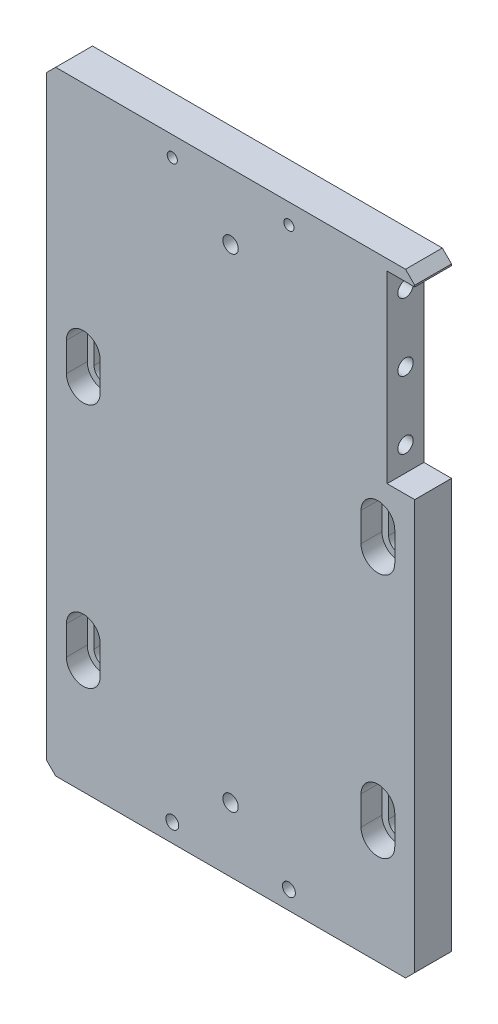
ISO-10303-21;
HEADER;
FILE_DESCRIPTION(('STEP AP214'),'2;1');
FILE_NAME('part.step','',(''),(''),'','','');
FILE_SCHEMA(('AUTOMOTIVE_DESIGN { 1 0 10303 214 1 1 1 1 }'));
ENDSEC;
DATA;
#1=APPLICATION_CONTEXT('core data for automotive mechanical design processes');
#2=APPLICATION_PROTOCOL_DEFINITION('international standard','automotive_design',2000,#1);
#3=PRODUCT_CONTEXT('',#1,'mechanical');
#4=PRODUCT('Part','Part','',(#3));
#5=PRODUCT_RELATED_PRODUCT_CATEGORY('part','',(#4));
#6=PRODUCT_DEFINITION_FORMATION('','',#4);
#7=PRODUCT_DEFINITION_CONTEXT('part definition',#1,'design');
#8=PRODUCT_DEFINITION('design','',#6,#7);
#9=PRODUCT_DEFINITION_SHAPE('','',#8);
#10=(LENGTH_UNIT() NAMED_UNIT(*) SI_UNIT(.MILLI.,.METRE.));
#11=(NAMED_UNIT(*) PLANE_ANGLE_UNIT() SI_UNIT($,.RADIAN.));
#12=(NAMED_UNIT(*) SI_UNIT($,.STERADIAN.) SOLID_ANGLE_UNIT());
#13=UNCERTAINTY_MEASURE_WITH_UNIT(LENGTH_MEASURE(1.E-05),#10,'distance_accuracy_value','');
#14=(GEOMETRIC_REPRESENTATION_CONTEXT(3) GLOBAL_UNCERTAINTY_ASSIGNED_CONTEXT((#13)) GLOBAL_UNIT_ASSIGNED_CONTEXT((#10,
#11,#12)) REPRESENTATION_CONTEXT('',''));
#15=CARTESIAN_POINT('',(0.,0.,0.));
#16=DIRECTION('',(0.,0.,1.));
#17=DIRECTION('',(1.,0.,0.));
#18=AXIS2_PLACEMENT_3D('',#15,#16,#17);
#19=CARTESIAN_POINT('',(0.,0.,12.));
#20=DIRECTION('',(0.,0.,-1.));
#21=DIRECTION('',(-1.,0.,0.));
#22=AXIS2_PLACEMENT_3D('',#19,#20,#21);
#23=PLANE('',#22);
#24=DIRECTION('',(0.,-1.,0.));
#25=VECTOR('',#24,1.);
#26=CARTESIAN_POINT('',(-42.5,-55.3,12.));
#27=LINE('',#26,#25);
#28=CARTESIAN_POINT('',(-42.5,-55.3,12.));
#29=VERTEX_POINT('',#28);
#30=CARTESIAN_POINT('',(-42.5,-64.7,12.));
#31=VERTEX_POINT('',#30);
#32=EDGE_CURVE('E382',#29,#31,#27,.T.);
#33=ORIENTED_EDGE('',*,*,#32,.T.);
#34=CARTESIAN_POINT('',(-48.,-64.7,12.));
#35=DIRECTION('',(0.,0.,1.));
#36=DIRECTION('',(1.,0.,0.));
#37=AXIS2_PLACEMENT_3D('',#34,#35,#36);
#38=CIRCLE('',#37,5.5);
#39=CARTESIAN_POINT('',(-53.5,-64.7,12.));
#40=VERTEX_POINT('',#39);
#41=EDGE_CURVE('E415',#40,#31,#38,.T.);
#42=ORIENTED_EDGE('',*,*,#41,.F.);
#43=DIRECTION('',(0.,-1.,0.));
#44=VECTOR('',#43,1.);
#45=CARTESIAN_POINT('',(-53.5,-55.3,12.));
#46=LINE('',#45,#44);
#47=CARTESIAN_POINT('',(-53.5,-55.3,12.));
#48=VERTEX_POINT('',#47);
#49=EDGE_CURVE('E365',#48,#40,#46,.T.);
#50=ORIENTED_EDGE('',*,*,#49,.F.);
#51=CARTESIAN_POINT('',(-48.,-55.3,12.));
#52=DIRECTION('',(0.,0.,1.));
#53=DIRECTION('',(1.,0.,0.));
#54=AXIS2_PLACEMENT_3D('',#51,#52,#53);
#55=CIRCLE('',#54,5.5);
#56=EDGE_CURVE('E394',#29,#48,#55,.T.);
#57=ORIENTED_EDGE('',*,*,#56,.F.);
#58=EDGE_LOOP('',(#33,#42,#50,#57));
#59=FACE_BOUND('',#58,.T.);
#60=DIRECTION('',(0.,-1.,0.));
#61=VECTOR('',#60,1.);
#62=CARTESIAN_POINT('',(53.5,24.7,12.));
#63=LINE('',#62,#61);
#64=CARTESIAN_POINT('',(53.5,24.7,12.));
#65=VERTEX_POINT('',#64);
#66=CARTESIAN_POINT('',(53.5,15.3,12.));
#67=VERTEX_POINT('',#66);
#68=EDGE_CURVE('E446',#65,#67,#63,.T.);
#69=ORIENTED_EDGE('',*,*,#68,.T.);
#70=CARTESIAN_POINT('',(48.,15.3,12.));
#71=DIRECTION('',(0.,0.,1.));
#72=DIRECTION('',(1.,0.,0.));
#73=AXIS2_PLACEMENT_3D('',#70,#71,#72);
#74=CIRCLE('',#73,5.5);
#75=CARTESIAN_POINT('',(42.5,15.3,12.));
#76=VERTEX_POINT('',#75);
#77=EDGE_CURVE('E479',#76,#67,#74,.T.);
#78=ORIENTED_EDGE('',*,*,#77,.F.);
#79=DIRECTION('',(0.,-1.,0.));
#80=VECTOR('',#79,1.);
#81=CARTESIAN_POINT('',(42.5,24.7,12.));
#82=LINE('',#81,#80);
#83=CARTESIAN_POINT('',(42.5,24.7,12.));
#84=VERTEX_POINT('',#83);
#85=EDGE_CURVE('E429',#84,#76,#82,.T.);
#86=ORIENTED_EDGE('',*,*,#85,.F.);
#87=CARTESIAN_POINT('',(48.,24.7,12.));
#88=DIRECTION('',(0.,0.,1.));
#89=DIRECTION('',(1.,0.,0.));
#90=AXIS2_PLACEMENT_3D('',#87,#88,#89);
#91=CIRCLE('',#90,5.5);
#92=EDGE_CURVE('E458',#65,#84,#91,.T.);
#93=ORIENTED_EDGE('',*,*,#92,.F.);
#94=EDGE_LOOP('',(#69,#78,#86,#93));
#95=FACE_BOUND('',#94,.T.);
#96=DIRECTION('',(0.,-1.,0.));
#97=VECTOR('',#96,1.);
#98=CARTESIAN_POINT('',(53.5,-55.3,12.));
#99=LINE('',#98,#97);
#100=CARTESIAN_POINT('',(53.5,-55.3,12.));
#101=VERTEX_POINT('',#100);
#102=CARTESIAN_POINT('',(53.5,-64.7,12.));
#103=VERTEX_POINT('',#102);
#104=EDGE_CURVE('E510',#101,#103,#99,.T.);
#105=ORIENTED_EDGE('',*,*,#104,.T.);
#106=CARTESIAN_POINT('',(48.,-64.7,12.));
#107=DIRECTION('',(0.,0.,1.));
#108=DIRECTION('',(1.,0.,0.));
#109=AXIS2_PLACEMENT_3D('',#106,#107,#108);
#110=CIRCLE('',#109,5.5);
#111=CARTESIAN_POINT('',(42.5,-64.7,12.));
#112=VERTEX_POINT('',#111);
#113=EDGE_CURVE('E543',#112,#103,#110,.T.);
#114=ORIENTED_EDGE('',*,*,#113,.F.);
#115=DIRECTION('',(0.,-1.,0.));
#116=VECTOR('',#115,1.);
#117=CARTESIAN_POINT('',(42.5,-55.3,12.));
#118=LINE('',#117,#116);
#119=CARTESIAN_POINT('',(42.5,-55.3,12.));
#120=VERTEX_POINT('',#119);
#121=EDGE_CURVE('E493',#120,#112,#118,.T.);
#122=ORIENTED_EDGE('',*,*,#121,.F.);
#123=CARTESIAN_POINT('',(48.,-55.3,12.));
#124=DIRECTION('',(0.,0.,1.));
#125=DIRECTION('',(1.,0.,0.));
#126=AXIS2_PLACEMENT_3D('',#123,#124,#125);
#127=CIRCLE('',#126,5.5);
#128=EDGE_CURVE('E522',#101,#120,#127,.T.);
#129=ORIENTED_EDGE('',*,*,#128,.F.);
#130=EDGE_LOOP('',(#105,#114,#122,#129));
#131=FACE_BOUND('',#130,.T.);
#132=CARTESIAN_POINT('',(-19.,93.5,12.));
#133=DIRECTION('',(0.,0.,1.));
#134=DIRECTION('',(1.,0.,0.));
#135=AXIS2_PLACEMENT_3D('',#132,#133,#134);
#136=CIRCLE('',#135,1.65);
#137=CARTESIAN_POINT('',(-17.35,93.5,12.));
#138=VERTEX_POINT('',#137);
#139=EDGE_CURVE('E596',#138,#138,#136,.T.);
#140=ORIENTED_EDGE('',*,*,#139,.F.);
#141=EDGE_LOOP('',(#140));
#142=FACE_BOUND('',#141,.T.);
#143=CARTESIAN_POINT('',(19.,93.5,12.));
#144=DIRECTION('',(0.,0.,1.));
#145=DIRECTION('',(1.,0.,0.));
#146=AXIS2_PLACEMENT_3D('',#143,#144,#145);
#147=CIRCLE('',#146,1.65);
#148=CARTESIAN_POINT('',(20.65,93.5,12.));
#149=VERTEX_POINT('',#148);
#150=EDGE_CURVE('E608',#149,#149,#147,.T.);
#151=ORIENTED_EDGE('',*,*,#150,.F.);
#152=EDGE_LOOP('',(#151));
#153=FACE_BOUND('',#152,.T.);
#154=CARTESIAN_POINT('',(-19.,-94.,12.));
#155=DIRECTION('',(0.,0.,1.));
#156=DIRECTION('',(1.,0.,0.));
#157=AXIS2_PLACEMENT_3D('',#154,#155,#156);
#158=CIRCLE('',#157,2.1);
#159=CARTESIAN_POINT('',(-16.9,-94.,12.));
#160=VERTEX_POINT('',#159);
#161=EDGE_CURVE('E614',#160,#160,#158,.T.);
#162=ORIENTED_EDGE('',*,*,#161,.F.);
#163=EDGE_LOOP('',(#162));
#164=FACE_BOUND('',#163,.T.);
#165=CARTESIAN_POINT('',(19.,-94.,12.));
#166=DIRECTION('',(0.,0.,1.));
#167=DIRECTION('',(1.,0.,0.));
#168=AXIS2_PLACEMENT_3D('',#165,#166,#167);
#169=CIRCLE('',#168,2.1);
#170=CARTESIAN_POINT('',(21.1,-94.,12.));
#171=VERTEX_POINT('',#170);
#172=EDGE_CURVE('E620',#171,#171,#169,.T.);
#173=ORIENTED_EDGE('',*,*,#172,.F.);
#174=EDGE_LOOP('',(#173));
#175=FACE_BOUND('',#174,.T.);
#176=CARTESIAN_POINT('',(0.,78.5,12.));
#177=DIRECTION('',(0.,0.,1.));
#178=DIRECTION('',(1.,0.,0.));
#179=AXIS2_PLACEMENT_3D('',#176,#177,#178);
#180=CIRCLE('',#179,2.5);
#181=CARTESIAN_POINT('',(2.50000000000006,78.5,12.));
#182=VERTEX_POINT('',#181);
#183=EDGE_CURVE('E626',#182,#182,#180,.T.);
#184=ORIENTED_EDGE('',*,*,#183,.F.);
#185=EDGE_LOOP('',(#184));
#186=FACE_BOUND('',#185,.T.);
#187=CARTESIAN_POINT('',(0.,-79.,12.));
#188=DIRECTION('',(0.,0.,1.));
#189=DIRECTION('',(1.,0.,0.));
#190=AXIS2_PLACEMENT_3D('',#187,#188,#189);
#191=CIRCLE('',#190,2.5);
#192=CARTESIAN_POINT('',(2.5,-79.,12.));
#193=VERTEX_POINT('',#192);
#194=EDGE_CURVE('E632',#193,#193,#191,.T.);
#195=ORIENTED_EDGE('',*,*,#194,.F.);
#196=EDGE_LOOP('',(#195));
#197=FACE_BOUND('',#196,.T.);
#198=DIRECTION('',(1.,0.,0.));
#199=VECTOR('',#198,1.);
#200=CARTESIAN_POINT('',(-60.,-100.,12.));
#201=LINE('',#200,#199);
#202=CARTESIAN_POINT('',(-57.,-100.,12.));
#203=VERTEX_POINT('',#202);
#204=CARTESIAN_POINT('',(57.,-100.,12.));
#205=VERTEX_POINT('',#204);
#206=EDGE_CURVE('E646',#203,#205,#201,.T.);
#207=ORIENTED_EDGE('',*,*,#206,.T.);
#208=DIRECTION('',(-0.707106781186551,-0.707106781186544,0.));
#209=VECTOR('',#208,1.);
#210=CARTESIAN_POINT('',(60.,-97.,12.));
#211=LINE('',#210,#209);
#212=CARTESIAN_POINT('',(60.,-97.,12.));
#213=VERTEX_POINT('',#212);
#214=EDGE_CURVE('E680',#205,#213,#211,.F.);
#215=ORIENTED_EDGE('',*,*,#214,.T.);
#216=DIRECTION('',(0.,1.,0.));
#217=VECTOR('',#216,1.);
#218=CARTESIAN_POINT('',(60.,-100.,12.));
#219=LINE('',#218,#217);
#220=CARTESIAN_POINT('',(60.,36.5,12.));
#221=VERTEX_POINT('',#220);
#222=EDGE_CURVE('E639',#213,#221,#219,.T.);
#223=ORIENTED_EDGE('',*,*,#222,.T.);
#224=DIRECTION('',(-1.,0.,0.));
#225=VECTOR('',#224,1.);
#226=CARTESIAN_POINT('',(60.,36.5,12.));
#227=LINE('',#226,#225);
#228=CARTESIAN_POINT('',(51.,36.5,12.));
#229=VERTEX_POINT('',#228);
#230=EDGE_CURVE('E576',#221,#229,#227,.T.);
#231=ORIENTED_EDGE('',*,*,#230,.T.);
#232=DIRECTION('',(0.,1.,0.));
#233=VECTOR('',#232,1.);
#234=CARTESIAN_POINT('',(51.,96.5,12.));
#235=LINE('',#234,#233);
#236=CARTESIAN_POINT('',(51.,96.5,12.));
#237=VERTEX_POINT('',#236);
#238=EDGE_CURVE('E579',#229,#237,#235,.T.);
#239=ORIENTED_EDGE('',*,*,#238,.T.);
#240=DIRECTION('',(1.,0.,0.));
#241=VECTOR('',#240,1.);
#242=CARTESIAN_POINT('',(60.,96.5,12.));
#243=LINE('',#242,#241);
#244=CARTESIAN_POINT('',(60.,96.5,12.));
#245=VERTEX_POINT('',#244);
#246=EDGE_CURVE('E583',#237,#245,#243,.T.);
#247=ORIENTED_EDGE('',*,*,#246,.T.);
#248=CARTESIAN_POINT('',(60.,97.,12.));
#249=VERTEX_POINT('',#248);
#250=EDGE_CURVE('E642',#245,#249,#219,.T.);
#251=ORIENTED_EDGE('',*,*,#250,.T.);
#252=DIRECTION('',(0.707106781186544,-0.707106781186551,0.));
#253=VECTOR('',#252,1.);
#254=CARTESIAN_POINT('',(57.,100.,12.));
#255=LINE('',#254,#253);
#256=CARTESIAN_POINT('',(57.,100.,12.));
#257=VERTEX_POINT('',#256);
#258=EDGE_CURVE('E676',#249,#257,#255,.F.);
#259=ORIENTED_EDGE('',*,*,#258,.T.);
#260=DIRECTION('',(-1.,0.,0.));
#261=VECTOR('',#260,1.);
#262=CARTESIAN_POINT('',(-60.,100.,12.));
#263=LINE('',#262,#261);
#264=CARTESIAN_POINT('',(-57.,100.,12.));
#265=VERTEX_POINT('',#264);
#266=EDGE_CURVE('E641',#257,#265,#263,.T.);
#267=ORIENTED_EDGE('',*,*,#266,.T.);
#268=DIRECTION('',(0.707106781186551,0.707106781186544,0.));
#269=VECTOR('',#268,1.);
#270=CARTESIAN_POINT('',(-60.,97.,12.));
#271=LINE('',#270,#269);
#272=CARTESIAN_POINT('',(-60.,97.,12.));
#273=VERTEX_POINT('',#272);
#274=EDGE_CURVE('E38',#265,#273,#271,.F.);
#275=ORIENTED_EDGE('',*,*,#274,.T.);
#276=DIRECTION('',(0.,-1.,0.));
#277=VECTOR('',#276,1.);
#278=CARTESIAN_POINT('',(-60.,-100.,12.));
#279=LINE('',#278,#277);
#280=CARTESIAN_POINT('',(-60.,-97.,12.));
#281=VERTEX_POINT('',#280);
#282=EDGE_CURVE('E644',#273,#281,#279,.T.);
#283=ORIENTED_EDGE('',*,*,#282,.T.);
#284=DIRECTION('',(-0.707106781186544,0.707106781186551,0.));
#285=VECTOR('',#284,1.);
#286=CARTESIAN_POINT('',(-57.,-100.,12.));
#287=LINE('',#286,#285);
#288=EDGE_CURVE('E678',#281,#203,#287,.F.);
#289=ORIENTED_EDGE('',*,*,#288,.T.);
#290=EDGE_LOOP('',(#207,#215,#223,#231,#239,#247,#251,#259,#267,#275,#283,#289));
#291=FACE_BOUND('',#290,.T.);
#292=DIRECTION('',(0.,-1.,0.));
#293=VECTOR('',#292,1.);
#294=CARTESIAN_POINT('',(-42.5,24.7,12.));
#295=LINE('',#294,#293);
#296=CARTESIAN_POINT('',(-42.5,24.7,12.));
#297=VERTEX_POINT('',#296);
#298=CARTESIAN_POINT('',(-42.5,15.3,12.));
#299=VERTEX_POINT('',#298);
#300=EDGE_CURVE('E308',#297,#299,#295,.T.);
#301=ORIENTED_EDGE('',*,*,#300,.T.);
#302=CARTESIAN_POINT('',(-48.,15.3,12.));
#303=DIRECTION('',(0.,0.,1.));
#304=DIRECTION('',(1.,0.,0.));
#305=AXIS2_PLACEMENT_3D('',#302,#303,#304);
#306=CIRCLE('',#305,5.5);
#307=CARTESIAN_POINT('',(-53.5,15.3,12.));
#308=VERTEX_POINT('',#307);
#309=EDGE_CURVE('E351',#308,#299,#306,.T.);
#310=ORIENTED_EDGE('',*,*,#309,.F.);
#311=DIRECTION('',(0.,-1.,0.));
#312=VECTOR('',#311,1.);
#313=CARTESIAN_POINT('',(-53.5,24.7,12.));
#314=LINE('',#313,#312);
#315=CARTESIAN_POINT('',(-53.5,24.7,12.));
#316=VERTEX_POINT('',#315);
#317=EDGE_CURVE('E331',#316,#308,#314,.T.);
#318=ORIENTED_EDGE('',*,*,#317,.F.);
#319=CARTESIAN_POINT('',(-48.,24.7,12.));
#320=DIRECTION('',(0.,0.,1.));
#321=DIRECTION('',(1.,0.,0.));
#322=AXIS2_PLACEMENT_3D('',#319,#320,#321);
#323=CIRCLE('',#322,5.5);
#324=EDGE_CURVE('E324',#297,#316,#323,.T.);
#325=ORIENTED_EDGE('',*,*,#324,.F.);
#326=EDGE_LOOP('',(#301,#310,#318,#325));
#327=FACE_BOUND('',#326,.T.);
#328=ADVANCED_FACE('F16',(#59,#95,#131,#142,#153,#164,#175,#186,#197,#291,#327),#23,.F.);
#329=CARTESIAN_POINT('',(0.,0.,0.));
#330=DIRECTION('',(0.,0.,-1.));
#331=DIRECTION('',(-1.,0.,0.));
#332=AXIS2_PLACEMENT_3D('',#329,#330,#331);
#333=PLANE('',#332);
#334=DIRECTION('',(0.,-1.,0.));
#335=VECTOR('',#334,1.);
#336=CARTESIAN_POINT('',(-44.7,-55.3,0.));
#337=LINE('',#336,#335);
#338=CARTESIAN_POINT('',(-44.7,-55.3,0.));
#339=VERTEX_POINT('',#338);
#340=CARTESIAN_POINT('',(-44.7,-64.7,0.));
#341=VERTEX_POINT('',#340);
#342=EDGE_CURVE('E374',#339,#341,#337,.T.);
#343=ORIENTED_EDGE('',*,*,#342,.F.);
#344=CARTESIAN_POINT('',(-48.,-55.3,0.));
#345=DIRECTION('',(0.,0.,1.));
#346=DIRECTION('',(1.,0.,0.));
#347=AXIS2_PLACEMENT_3D('',#344,#345,#346);
#348=CIRCLE('',#347,3.3);
#349=CARTESIAN_POINT('',(-51.3,-55.3,0.));
#350=VERTEX_POINT('',#349);
#351=EDGE_CURVE('E402',#339,#350,#348,.T.);
#352=ORIENTED_EDGE('',*,*,#351,.T.);
#353=DIRECTION('',(0.,-1.,0.));
#354=VECTOR('',#353,1.);
#355=CARTESIAN_POINT('',(-51.3,-55.3,0.));
#356=LINE('',#355,#354);
#357=CARTESIAN_POINT('',(-51.3,-64.7,0.));
#358=VERTEX_POINT('',#357);
#359=EDGE_CURVE('E371',#350,#358,#356,.T.);
#360=ORIENTED_EDGE('',*,*,#359,.T.);
#361=CARTESIAN_POINT('',(-48.,-64.7,0.));
#362=DIRECTION('',(0.,0.,1.));
#363=DIRECTION('',(1.,0.,0.));
#364=AXIS2_PLACEMENT_3D('',#361,#362,#363);
#365=CIRCLE('',#364,3.3);
#366=EDGE_CURVE('E423',#358,#341,#365,.T.);
#367=ORIENTED_EDGE('',*,*,#366,.T.);
#368=EDGE_LOOP('',(#343,#352,#360,#367));
#369=FACE_BOUND('',#368,.T.);
#370=CARTESIAN_POINT('',(48.,15.3,0.));
#371=DIRECTION('',(0.,0.,1.));
#372=DIRECTION('',(1.,0.,0.));
#373=AXIS2_PLACEMENT_3D('',#370,#371,#372);
#374=CIRCLE('',#373,3.3);
#375=CARTESIAN_POINT('',(44.7,15.3,0.));
#376=VERTEX_POINT('',#375);
#377=CARTESIAN_POINT('',(51.3,15.3,0.));
#378=VERTEX_POINT('',#377);
#379=EDGE_CURVE('E487',#376,#378,#374,.T.);
#380=ORIENTED_EDGE('',*,*,#379,.T.);
#381=DIRECTION('',(0.,-1.,0.));
#382=VECTOR('',#381,1.);
#383=CARTESIAN_POINT('',(51.3,24.7,0.));
#384=LINE('',#383,#382);
#385=CARTESIAN_POINT('',(51.3,24.7,0.));
#386=VERTEX_POINT('',#385);
#387=EDGE_CURVE('E438',#386,#378,#384,.T.);
#388=ORIENTED_EDGE('',*,*,#387,.F.);
#389=CARTESIAN_POINT('',(48.,24.7,0.));
#390=DIRECTION('',(0.,0.,1.));
#391=DIRECTION('',(1.,0.,0.));
#392=AXIS2_PLACEMENT_3D('',#389,#390,#391);
#393=CIRCLE('',#392,3.3);
#394=CARTESIAN_POINT('',(44.7,24.7,0.));
#395=VERTEX_POINT('',#394);
#396=EDGE_CURVE('E466',#386,#395,#393,.T.);
#397=ORIENTED_EDGE('',*,*,#396,.T.);
#398=DIRECTION('',(0.,-1.,0.));
#399=VECTOR('',#398,1.);
#400=CARTESIAN_POINT('',(44.7,24.7,0.));
#401=LINE('',#400,#399);
#402=EDGE_CURVE('E435',#395,#376,#401,.T.);
#403=ORIENTED_EDGE('',*,*,#402,.T.);
#404=EDGE_LOOP('',(#380,#388,#397,#403));
#405=FACE_BOUND('',#404,.T.);
#406=DIRECTION('',(0.,-1.,0.));
#407=VECTOR('',#406,1.);
#408=CARTESIAN_POINT('',(51.3,-55.3,0.));
#409=LINE('',#408,#407);
#410=CARTESIAN_POINT('',(51.3,-55.3,0.));
#411=VERTEX_POINT('',#410);
#412=CARTESIAN_POINT('',(51.3,-64.7,0.));
#413=VERTEX_POINT('',#412);
#414=EDGE_CURVE('E502',#411,#413,#409,.T.);
#415=ORIENTED_EDGE('',*,*,#414,.F.);
#416=CARTESIAN_POINT('',(48.,-55.3,0.));
#417=DIRECTION('',(0.,0.,1.));
#418=DIRECTION('',(1.,0.,0.));
#419=AXIS2_PLACEMENT_3D('',#416,#417,#418);
#420=CIRCLE('',#419,3.3);
#421=CARTESIAN_POINT('',(44.7,-55.3,0.));
#422=VERTEX_POINT('',#421);
#423=EDGE_CURVE('E530',#411,#422,#420,.T.);
#424=ORIENTED_EDGE('',*,*,#423,.T.);
#425=DIRECTION('',(0.,-1.,0.));
#426=VECTOR('',#425,1.);
#427=CARTESIAN_POINT('',(44.7,-55.3,0.));
#428=LINE('',#427,#426);
#429=CARTESIAN_POINT('',(44.7,-64.7,0.));
#430=VERTEX_POINT('',#429);
#431=EDGE_CURVE('E499',#422,#430,#428,.T.);
#432=ORIENTED_EDGE('',*,*,#431,.T.);
#433=CARTESIAN_POINT('',(48.,-64.7,0.));
#434=DIRECTION('',(0.,0.,1.));
#435=DIRECTION('',(1.,0.,0.));
#436=AXIS2_PLACEMENT_3D('',#433,#434,#435);
#437=CIRCLE('',#436,3.3);
#438=EDGE_CURVE('E551',#430,#413,#437,.T.);
#439=ORIENTED_EDGE('',*,*,#438,.T.);
#440=EDGE_LOOP('',(#415,#424,#432,#439));
#441=FACE_BOUND('',#440,.T.);
#442=DIRECTION('',(0.,1.,0.));
#443=VECTOR('',#442,1.);
#444=CARTESIAN_POINT('',(60.,-100.,0.));
#445=LINE('',#444,#443);
#446=CARTESIAN_POINT('',(60.,-97.,0.));
#447=VERTEX_POINT('',#446);
#448=CARTESIAN_POINT('',(60.,36.5,0.));
#449=VERTEX_POINT('',#448);
#450=EDGE_CURVE('E650',#447,#449,#445,.T.);
#451=ORIENTED_EDGE('',*,*,#450,.F.);
#452=DIRECTION('',(0.707106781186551,0.707106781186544,0.));
#453=VECTOR('',#452,1.);
#454=CARTESIAN_POINT('',(78.5,-78.5,0.));
#455=LINE('',#454,#453);
#456=CARTESIAN_POINT('',(57.,-100.,0.));
#457=VERTEX_POINT('',#456);
#458=EDGE_CURVE('E668',#447,#457,#455,.F.);
#459=ORIENTED_EDGE('',*,*,#458,.T.);
#460=DIRECTION('',(1.,0.,0.));
#461=VECTOR('',#460,1.);
#462=CARTESIAN_POINT('',(-60.,-100.,0.));
#463=LINE('',#462,#461);
#464=CARTESIAN_POINT('',(-57.,-100.,0.));
#465=VERTEX_POINT('',#464);
#466=EDGE_CURVE('E657',#465,#457,#463,.T.);
#467=ORIENTED_EDGE('',*,*,#466,.F.);
#468=DIRECTION('',(0.707106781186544,-0.707106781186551,0.));
#469=VECTOR('',#468,1.);
#470=CARTESIAN_POINT('',(-78.5,-78.5,0.));
#471=LINE('',#470,#469);
#472=CARTESIAN_POINT('',(-60.,-97.,0.));
#473=VERTEX_POINT('',#472);
#474=EDGE_CURVE('E666',#465,#473,#471,.F.);
#475=ORIENTED_EDGE('',*,*,#474,.T.);
#476=DIRECTION('',(0.,-1.,0.));
#477=VECTOR('',#476,1.);
#478=CARTESIAN_POINT('',(-60.,-100.,0.));
#479=LINE('',#478,#477);
#480=CARTESIAN_POINT('',(-60.,97.,0.));
#481=VERTEX_POINT('',#480);
#482=EDGE_CURVE('E655',#481,#473,#479,.T.);
#483=ORIENTED_EDGE('',*,*,#482,.F.);
#484=DIRECTION('',(-0.707106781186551,-0.707106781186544,0.));
#485=VECTOR('',#484,1.);
#486=CARTESIAN_POINT('',(-78.5,78.5,0.));
#487=LINE('',#486,#485);
#488=CARTESIAN_POINT('',(-57.,100.,0.));
#489=VERTEX_POINT('',#488);
#490=EDGE_CURVE('E662',#481,#489,#487,.F.);
#491=ORIENTED_EDGE('',*,*,#490,.T.);
#492=DIRECTION('',(-1.,0.,0.));
#493=VECTOR('',#492,1.);
#494=CARTESIAN_POINT('',(-60.,100.,0.));
#495=LINE('',#494,#493);
#496=CARTESIAN_POINT('',(57.,100.,0.));
#497=VERTEX_POINT('',#496);
#498=EDGE_CURVE('E652',#497,#489,#495,.T.);
#499=ORIENTED_EDGE('',*,*,#498,.F.);
#500=DIRECTION('',(-0.707106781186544,0.707106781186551,0.));
#501=VECTOR('',#500,1.);
#502=CARTESIAN_POINT('',(78.5,78.5,0.));
#503=LINE('',#502,#501);
#504=CARTESIAN_POINT('',(60.,97.,0.));
#505=VERTEX_POINT('',#504);
#506=EDGE_CURVE('E664',#497,#505,#503,.F.);
#507=ORIENTED_EDGE('',*,*,#506,.T.);
#508=CARTESIAN_POINT('',(60.,96.5,0.));
#509=VERTEX_POINT('',#508);
#510=EDGE_CURVE('E638',#509,#505,#445,.T.);
#511=ORIENTED_EDGE('',*,*,#510,.F.);
#512=DIRECTION('',(1.,0.,0.));
#513=VECTOR('',#512,1.);
#514=CARTESIAN_POINT('',(60.,96.5,0.));
#515=LINE('',#514,#513);
#516=CARTESIAN_POINT('',(51.,96.5,0.));
#517=VERTEX_POINT('',#516);
#518=EDGE_CURVE('E580',#517,#509,#515,.T.);
#519=ORIENTED_EDGE('',*,*,#518,.F.);
#520=DIRECTION('',(0.,1.,0.));
#521=VECTOR('',#520,1.);
#522=CARTESIAN_POINT('',(51.,96.5,0.));
#523=LINE('',#522,#521);
#524=CARTESIAN_POINT('',(51.,36.5,0.));
#525=VERTEX_POINT('',#524);
#526=EDGE_CURVE('E589',#525,#517,#523,.T.);
#527=ORIENTED_EDGE('',*,*,#526,.F.);
#528=DIRECTION('',(-1.,0.,0.));
#529=VECTOR('',#528,1.);
#530=CARTESIAN_POINT('',(60.,36.5,0.));
#531=LINE('',#530,#529);
#532=EDGE_CURVE('E575',#449,#525,#531,.T.);
#533=ORIENTED_EDGE('',*,*,#532,.F.);
#534=EDGE_LOOP('',(#451,#459,#467,#475,#483,#491,#499,#507,#511,#519,#527,#533));
#535=FACE_BOUND('',#534,.T.);
#536=CARTESIAN_POINT('',(-19.,93.5,0.));
#537=DIRECTION('',(0.,0.,1.));
#538=DIRECTION('',(1.,0.,0.));
#539=AXIS2_PLACEMENT_3D('',#536,#537,#538);
#540=CIRCLE('',#539,1.65);
#541=CARTESIAN_POINT('',(-17.35,93.5,0.));
#542=VERTEX_POINT('',#541);
#543=EDGE_CURVE('E605',#542,#542,#540,.T.);
#544=ORIENTED_EDGE('',*,*,#543,.T.);
#545=EDGE_LOOP('',(#544));
#546=FACE_BOUND('',#545,.T.);
#547=CARTESIAN_POINT('',(19.,93.5,0.));
#548=DIRECTION('',(0.,0.,1.));
#549=DIRECTION('',(1.,0.,0.));
#550=AXIS2_PLACEMENT_3D('',#547,#548,#549);
#551=CIRCLE('',#550,1.65);
#552=CARTESIAN_POINT('',(20.65,93.5,0.));
#553=VERTEX_POINT('',#552);
#554=EDGE_CURVE('E611',#553,#553,#551,.T.);
#555=ORIENTED_EDGE('',*,*,#554,.T.);
#556=EDGE_LOOP('',(#555));
#557=FACE_BOUND('',#556,.T.);
#558=CARTESIAN_POINT('',(-19.,-94.,0.));
#559=DIRECTION('',(0.,0.,1.));
#560=DIRECTION('',(1.,0.,0.));
#561=AXIS2_PLACEMENT_3D('',#558,#559,#560);
#562=CIRCLE('',#561,2.1);
#563=CARTESIAN_POINT('',(-16.9,-94.,0.));
#564=VERTEX_POINT('',#563);
#565=EDGE_CURVE('E617',#564,#564,#562,.T.);
#566=ORIENTED_EDGE('',*,*,#565,.T.);
#567=EDGE_LOOP('',(#566));
#568=FACE_BOUND('',#567,.T.);
#569=CARTESIAN_POINT('',(19.,-94.,0.));
#570=DIRECTION('',(0.,0.,1.));
#571=DIRECTION('',(1.,0.,0.));
#572=AXIS2_PLACEMENT_3D('',#569,#570,#571);
#573=CIRCLE('',#572,2.1);
#574=CARTESIAN_POINT('',(21.1,-94.,0.));
#575=VERTEX_POINT('',#574);
#576=EDGE_CURVE('E623',#575,#575,#573,.T.);
#577=ORIENTED_EDGE('',*,*,#576,.T.);
#578=EDGE_LOOP('',(#577));
#579=FACE_BOUND('',#578,.T.);
#580=CARTESIAN_POINT('',(0.,78.5,0.));
#581=DIRECTION('',(0.,0.,1.));
#582=DIRECTION('',(1.,0.,0.));
#583=AXIS2_PLACEMENT_3D('',#580,#581,#582);
#584=CIRCLE('',#583,2.5);
#585=CARTESIAN_POINT('',(2.50000000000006,78.5,0.));
#586=VERTEX_POINT('',#585);
#587=EDGE_CURVE('E629',#586,#586,#584,.T.);
#588=ORIENTED_EDGE('',*,*,#587,.T.);
#589=EDGE_LOOP('',(#588));
#590=FACE_BOUND('',#589,.T.);
#591=CARTESIAN_POINT('',(0.,-79.,0.));
#592=DIRECTION('',(0.,0.,1.));
#593=DIRECTION('',(1.,0.,0.));
#594=AXIS2_PLACEMENT_3D('',#591,#592,#593);
#595=CIRCLE('',#594,2.5);
#596=CARTESIAN_POINT('',(2.5,-79.,0.));
#597=VERTEX_POINT('',#596);
#598=EDGE_CURVE('E635',#597,#597,#595,.T.);
#599=ORIENTED_EDGE('',*,*,#598,.T.);
#600=EDGE_LOOP('',(#599));
#601=FACE_BOUND('',#600,.T.);
#602=CARTESIAN_POINT('',(-48.,15.3,0.));
#603=DIRECTION('',(0.,0.,1.));
#604=DIRECTION('',(1.,0.,0.));
#605=AXIS2_PLACEMENT_3D('',#602,#603,#604);
#606=CIRCLE('',#605,3.3);
#607=CARTESIAN_POINT('',(-51.3,15.3,0.));
#608=VERTEX_POINT('',#607);
#609=CARTESIAN_POINT('',(-44.7,15.3,0.));
#610=VERTEX_POINT('',#609);
#611=EDGE_CURVE('E359',#608,#610,#606,.T.);
#612=ORIENTED_EDGE('',*,*,#611,.T.);
#613=DIRECTION('',(0.,-1.,0.));
#614=VECTOR('',#613,1.);
#615=CARTESIAN_POINT('',(-44.7,24.7,0.));
#616=LINE('',#615,#614);
#617=CARTESIAN_POINT('',(-44.7,24.7,0.));
#618=VERTEX_POINT('',#617);
#619=EDGE_CURVE('E986',#618,#610,#616,.T.);
#620=ORIENTED_EDGE('',*,*,#619,.F.);
#621=CARTESIAN_POINT('',(-48.,24.7,0.));
#622=DIRECTION('',(0.,0.,1.));
#623=DIRECTION('',(1.,0.,0.));
#624=AXIS2_PLACEMENT_3D('',#621,#622,#623);
#625=CIRCLE('',#624,3.3);
#626=CARTESIAN_POINT('',(-51.3,24.7,0.));
#627=VERTEX_POINT('',#626);
#628=EDGE_CURVE('E340',#618,#627,#625,.T.);
#629=ORIENTED_EDGE('',*,*,#628,.T.);
#630=DIRECTION('',(0.,-1.,0.));
#631=VECTOR('',#630,1.);
#632=CARTESIAN_POINT('',(-51.3,24.7,0.));
#633=LINE('',#632,#631);
#634=EDGE_CURVE('E987',#627,#608,#633,.T.);
#635=ORIENTED_EDGE('',*,*,#634,.T.);
#636=EDGE_LOOP('',(#612,#620,#629,#635));
#637=FACE_BOUND('',#636,.T.);
#638=ADVANCED_FACE('F698',(#369,#405,#441,#535,#546,#557,#568,#579,#590,#601,#637),#333,.T.);
#639=CARTESIAN_POINT('',(60.,-100.,12.));
#640=DIRECTION('',(-1.,0.,0.));
#641=DIRECTION('',(0.,0.,1.));
#642=AXIS2_PLACEMENT_3D('',#639,#640,#641);
#643=PLANE('',#642);
#644=ORIENTED_EDGE('',*,*,#510,.T.);
#645=DIRECTION('',(0.,0.,1.));
#646=VECTOR('',#645,1.);
#647=CARTESIAN_POINT('',(60.,97.,12.));
#648=LINE('',#647,#646);
#649=EDGE_CURVE('E11',#505,#249,#648,.T.);
#650=ORIENTED_EDGE('',*,*,#649,.T.);
#651=ORIENTED_EDGE('',*,*,#250,.F.);
#652=DIRECTION('',(0.,0.,-1.));
#653=VECTOR('',#652,1.);
#654=CARTESIAN_POINT('',(60.,96.5,12.));
#655=LINE('',#654,#653);
#656=EDGE_CURVE('E593',#245,#509,#655,.T.);
#657=ORIENTED_EDGE('',*,*,#656,.T.);
#658=EDGE_LOOP('',(#644,#650,#651,#657));
#659=FACE_BOUND('',#658,.T.);
#660=ADVANCED_FACE('F736',(#659),#643,.F.);
#661=ORIENTED_EDGE('',*,*,#222,.F.);
#662=DIRECTION('',(0.,0.,-1.));
#663=VECTOR('',#662,1.);
#664=CARTESIAN_POINT('',(60.,-97.,12.));
#665=LINE('',#664,#663);
#666=EDGE_CURVE('E649',#213,#447,#665,.T.);
#667=ORIENTED_EDGE('',*,*,#666,.T.);
#668=ORIENTED_EDGE('',*,*,#450,.T.);
#669=DIRECTION('',(0.,0.,-1.));
#670=VECTOR('',#669,1.);
#671=CARTESIAN_POINT('',(60.,36.5,12.));
#672=LINE('',#671,#670);
#673=EDGE_CURVE('E586',#221,#449,#672,.T.);
#674=ORIENTED_EDGE('',*,*,#673,.F.);
#675=EDGE_LOOP('',(#661,#667,#668,#674));
#676=FACE_BOUND('',#675,.T.);
#677=ADVANCED_FACE('F722',(#676),#643,.F.);
#678=CARTESIAN_POINT('',(-60.,100.,12.));
#679=DIRECTION('',(0.,-1.,0.));
#680=DIRECTION('',(0.,0.,-1.));
#681=AXIS2_PLACEMENT_3D('',#678,#679,#680);
#682=PLANE('',#681);
#683=ORIENTED_EDGE('',*,*,#266,.F.);
#684=DIRECTION('',(0.,0.,-1.));
#685=VECTOR('',#684,1.);
#686=CARTESIAN_POINT('',(57.,100.,12.));
#687=LINE('',#686,#685);
#688=EDGE_CURVE('E24',#257,#497,#687,.T.);
#689=ORIENTED_EDGE('',*,*,#688,.T.);
#690=ORIENTED_EDGE('',*,*,#498,.T.);
#691=DIRECTION('',(0.,0.,1.));
#692=VECTOR('',#691,1.);
#693=CARTESIAN_POINT('',(-57.,100.,12.));
#694=LINE('',#693,#692);
#695=EDGE_CURVE('E686',#489,#265,#694,.T.);
#696=ORIENTED_EDGE('',*,*,#695,.T.);
#697=EDGE_LOOP('',(#683,#689,#690,#696));
#698=FACE_BOUND('',#697,.T.);
#699=ADVANCED_FACE('F692',(#698),#682,.F.);
#700=CARTESIAN_POINT('',(-60.,-100.,12.));
#701=DIRECTION('',(1.,0.,0.));
#702=DIRECTION('',(0.,0.,-1.));
#703=AXIS2_PLACEMENT_3D('',#700,#701,#702);
#704=PLANE('',#703);
#705=ORIENTED_EDGE('',*,*,#482,.T.);
#706=DIRECTION('',(0.,0.,1.));
#707=VECTOR('',#706,1.);
#708=CARTESIAN_POINT('',(-60.,-97.,12.));
#709=LINE('',#708,#707);
#710=EDGE_CURVE('E31',#473,#281,#709,.T.);
#711=ORIENTED_EDGE('',*,*,#710,.T.);
#712=ORIENTED_EDGE('',*,*,#282,.F.);
#713=DIRECTION('',(0.,0.,-1.));
#714=VECTOR('',#713,1.);
#715=CARTESIAN_POINT('',(-60.,97.,12.));
#716=LINE('',#715,#714);
#717=EDGE_CURVE('E682',#273,#481,#716,.T.);
#718=ORIENTED_EDGE('',*,*,#717,.T.);
#719=EDGE_LOOP('',(#705,#711,#712,#718));
#720=FACE_BOUND('',#719,.T.);
#721=ADVANCED_FACE('F705',(#720),#704,.F.);
#722=CARTESIAN_POINT('',(-60.,-100.,12.));
#723=DIRECTION('',(0.,1.,0.));
#724=DIRECTION('',(0.,0.,1.));
#725=AXIS2_PLACEMENT_3D('',#722,#723,#724);
#726=PLANE('',#725);
#727=ORIENTED_EDGE('',*,*,#466,.T.);
#728=DIRECTION('',(0.,0.,1.));
#729=VECTOR('',#728,1.);
#730=CARTESIAN_POINT('',(57.,-100.,12.));
#731=LINE('',#730,#729);
#732=EDGE_CURVE('E673',#457,#205,#731,.T.);
#733=ORIENTED_EDGE('',*,*,#732,.T.);
#734=ORIENTED_EDGE('',*,*,#206,.F.);
#735=DIRECTION('',(0.,0.,-1.));
#736=VECTOR('',#735,1.);
#737=CARTESIAN_POINT('',(-57.,-100.,12.));
#738=LINE('',#737,#736);
#739=EDGE_CURVE('E670',#203,#465,#738,.T.);
#740=ORIENTED_EDGE('',*,*,#739,.T.);
#741=EDGE_LOOP('',(#727,#733,#734,#740));
#742=FACE_BOUND('',#741,.T.);
#743=ADVANCED_FACE('F713',(#742),#726,.F.);
#744=CARTESIAN_POINT('',(0.,-79.,12.));
#745=DIRECTION('',(0.,0.,1.));
#746=DIRECTION('',(1.,0.,0.));
#747=AXIS2_PLACEMENT_3D('',#744,#745,#746);
#748=CYLINDRICAL_SURFACE('',#747,2.5);
#749=ORIENTED_EDGE('',*,*,#598,.F.);
#750=EDGE_LOOP('',(#749));
#751=FACE_BOUND('',#750,.T.);
#752=ORIENTED_EDGE('',*,*,#194,.T.);
#753=EDGE_LOOP('',(#752));
#754=FACE_BOUND('',#753,.T.);
#755=ADVANCED_FACE('F758',(#751,#754),#748,.F.);
#756=CARTESIAN_POINT('',(0.,78.5,12.));
#757=DIRECTION('',(0.,0.,1.));
#758=DIRECTION('',(1.,0.,0.));
#759=AXIS2_PLACEMENT_3D('',#756,#757,#758);
#760=CYLINDRICAL_SURFACE('',#759,2.5);
#761=ORIENTED_EDGE('',*,*,#587,.F.);
#762=EDGE_LOOP('',(#761));
#763=FACE_BOUND('',#762,.T.);
#764=ORIENTED_EDGE('',*,*,#183,.T.);
#765=EDGE_LOOP('',(#764));
#766=FACE_BOUND('',#765,.T.);
#767=ADVANCED_FACE('F963',(#763,#766),#760,.F.);
#768=CARTESIAN_POINT('',(19.,-94.,12.));
#769=DIRECTION('',(0.,0.,1.));
#770=DIRECTION('',(1.,0.,0.));
#771=AXIS2_PLACEMENT_3D('',#768,#769,#770);
#772=CYLINDRICAL_SURFACE('',#771,2.1);
#773=ORIENTED_EDGE('',*,*,#576,.F.);
#774=EDGE_LOOP('',(#773));
#775=FACE_BOUND('',#774,.T.);
#776=ORIENTED_EDGE('',*,*,#172,.T.);
#777=EDGE_LOOP('',(#776));
#778=FACE_BOUND('',#777,.T.);
#779=ADVANCED_FACE('F960',(#775,#778),#772,.F.);
#780=CARTESIAN_POINT('',(-19.,-94.,12.));
#781=DIRECTION('',(0.,0.,1.));
#782=DIRECTION('',(1.,0.,0.));
#783=AXIS2_PLACEMENT_3D('',#780,#781,#782);
#784=CYLINDRICAL_SURFACE('',#783,2.1);
#785=ORIENTED_EDGE('',*,*,#565,.F.);
#786=EDGE_LOOP('',(#785));
#787=FACE_BOUND('',#786,.T.);
#788=ORIENTED_EDGE('',*,*,#161,.T.);
#789=EDGE_LOOP('',(#788));
#790=FACE_BOUND('',#789,.T.);
#791=ADVANCED_FACE('F956',(#787,#790),#784,.F.);
#792=CARTESIAN_POINT('',(19.,93.5,12.));
#793=DIRECTION('',(0.,0.,1.));
#794=DIRECTION('',(1.,0.,0.));
#795=AXIS2_PLACEMENT_3D('',#792,#793,#794);
#796=CYLINDRICAL_SURFACE('',#795,1.65);
#797=ORIENTED_EDGE('',*,*,#554,.F.);
#798=EDGE_LOOP('',(#797));
#799=FACE_BOUND('',#798,.T.);
#800=ORIENTED_EDGE('',*,*,#150,.T.);
#801=EDGE_LOOP('',(#800));
#802=FACE_BOUND('',#801,.T.);
#803=ADVANCED_FACE('F952',(#799,#802),#796,.F.);
#804=CARTESIAN_POINT('',(-19.,93.5,12.));
#805=DIRECTION('',(0.,0.,1.));
#806=DIRECTION('',(1.,0.,0.));
#807=AXIS2_PLACEMENT_3D('',#804,#805,#806);
#808=CYLINDRICAL_SURFACE('',#807,1.65);
#809=ORIENTED_EDGE('',*,*,#543,.F.);
#810=EDGE_LOOP('',(#809));
#811=FACE_BOUND('',#810,.T.);
#812=ORIENTED_EDGE('',*,*,#139,.T.);
#813=EDGE_LOOP('',(#812));
#814=FACE_BOUND('',#813,.T.);
#815=ADVANCED_FACE('F944',(#811,#814),#808,.F.);
#816=CARTESIAN_POINT('',(60.,96.5,12.));
#817=DIRECTION('',(0.,1.,0.));
#818=DIRECTION('',(0.,0.,1.));
#819=AXIS2_PLACEMENT_3D('',#816,#817,#818);
#820=PLANE('',#819);
#821=ORIENTED_EDGE('',*,*,#518,.T.);
#822=ORIENTED_EDGE('',*,*,#656,.F.);
#823=ORIENTED_EDGE('',*,*,#246,.F.);
#824=DIRECTION('',(0.,0.,-1.));
#825=VECTOR('',#824,1.);
#826=CARTESIAN_POINT('',(51.,96.5,12.));
#827=LINE('',#826,#825);
#828=EDGE_CURVE('E597',#237,#517,#827,.T.);
#829=ORIENTED_EDGE('',*,*,#828,.T.);
#830=EDGE_LOOP('',(#821,#822,#823,#829));
#831=FACE_BOUND('',#830,.T.);
#832=ADVANCED_FACE('F941',(#831),#820,.F.);
#833=CARTESIAN_POINT('',(51.,96.5,12.));
#834=DIRECTION('',(-1.,0.,0.));
#835=DIRECTION('',(0.,-1.,0.));
#836=AXIS2_PLACEMENT_3D('',#833,#834,#835);
#837=PLANE('',#836);
#838=CARTESIAN_POINT('',(51.,44.5,6.));
#839=DIRECTION('',(1.,0.,0.));
#840=DIRECTION('',(0.,0.,-1.));
#841=AXIS2_PLACEMENT_3D('',#838,#839,#840);
#842=CIRCLE('',#841,2.5);
#843=CARTESIAN_POINT('',(51.,44.5,3.5));
#844=VERTEX_POINT('',#843);
#845=EDGE_CURVE('E557',#844,#844,#842,.T.);
#846=ORIENTED_EDGE('',*,*,#845,.F.);
#847=EDGE_LOOP('',(#846));
#848=FACE_BOUND('',#847,.T.);
#849=CARTESIAN_POINT('',(51.,66.5,6.));
#850=DIRECTION('',(1.,0.,0.));
#851=DIRECTION('',(0.,0.,-1.));
#852=AXIS2_PLACEMENT_3D('',#849,#850,#851);
#853=CIRCLE('',#852,2.5);
#854=CARTESIAN_POINT('',(51.,66.5,3.5));
#855=VERTEX_POINT('',#854);
#856=EDGE_CURVE('E563',#855,#855,#853,.T.);
#857=ORIENTED_EDGE('',*,*,#856,.F.);
#858=EDGE_LOOP('',(#857));
#859=FACE_BOUND('',#858,.T.);
#860=CARTESIAN_POINT('',(51.,88.5,6.));
#861=DIRECTION('',(1.,0.,0.));
#862=DIRECTION('',(0.,0.,-1.));
#863=AXIS2_PLACEMENT_3D('',#860,#861,#862);
#864=CIRCLE('',#863,2.5);
#865=CARTESIAN_POINT('',(51.,88.5,3.5));
#866=VERTEX_POINT('',#865);
#867=EDGE_CURVE('E569',#866,#866,#864,.T.);
#868=ORIENTED_EDGE('',*,*,#867,.F.);
#869=EDGE_LOOP('',(#868));
#870=FACE_BOUND('',#869,.T.);
#871=ORIENTED_EDGE('',*,*,#526,.T.);
#872=ORIENTED_EDGE('',*,*,#828,.F.);
#873=ORIENTED_EDGE('',*,*,#238,.F.);
#874=DIRECTION('',(0.,0.,-1.));
#875=VECTOR('',#874,1.);
#876=CARTESIAN_POINT('',(51.,36.5,12.));
#877=LINE('',#876,#875);
#878=EDGE_CURVE('E599',#229,#525,#877,.T.);
#879=ORIENTED_EDGE('',*,*,#878,.T.);
#880=EDGE_LOOP('',(#871,#872,#873,#879));
#881=FACE_BOUND('',#880,.T.);
#882=ADVANCED_FACE('F730',(#848,#859,#870,#881),#837,.F.);
#883=CARTESIAN_POINT('',(60.,36.5,12.));
#884=DIRECTION('',(0.,-1.,0.));
#885=DIRECTION('',(0.,0.,-1.));
#886=AXIS2_PLACEMENT_3D('',#883,#884,#885);
#887=PLANE('',#886);
#888=ORIENTED_EDGE('',*,*,#532,.T.);
#889=ORIENTED_EDGE('',*,*,#878,.F.);
#890=ORIENTED_EDGE('',*,*,#230,.F.);
#891=ORIENTED_EDGE('',*,*,#673,.T.);
#892=EDGE_LOOP('',(#888,#889,#890,#891));
#893=FACE_BOUND('',#892,.T.);
#894=ADVANCED_FACE('F726',(#893),#887,.F.);
#895=CARTESIAN_POINT('',(34.,88.5,6.));
#896=DIRECTION('',(1.,0.,0.));
#897=DIRECTION('',(0.,0.,-1.));
#898=AXIS2_PLACEMENT_3D('',#895,#896,#897);
#899=CONICAL_SURFACE('',#898,2.5,1.02974425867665);
#900=CARTESIAN_POINT('',(32.4978484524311,88.5,6.));
#901=VERTEX_POINT('',#900);
#902=VERTEX_LOOP('',#901);
#903=FACE_BOUND('',#902,.T.);
#904=CARTESIAN_POINT('',(34.,88.5,6.));
#905=DIRECTION('',(1.,0.,0.));
#906=DIRECTION('',(0.,0.,-1.));
#907=AXIS2_PLACEMENT_3D('',#904,#905,#906);
#908=CIRCLE('',#907,2.5);
#909=CARTESIAN_POINT('',(34.,88.5,3.5));
#910=VERTEX_POINT('',#909);
#911=EDGE_CURVE('E572',#910,#910,#908,.T.);
#912=ORIENTED_EDGE('',*,*,#911,.T.);
#913=EDGE_LOOP('',(#912));
#914=FACE_BOUND('',#913,.T.);
#915=ADVANCED_FACE('F936',(#903,#914),#899,.F.);
#916=CARTESIAN_POINT('',(51.,88.5,6.));
#917=DIRECTION('',(1.,0.,0.));
#918=DIRECTION('',(0.,0.,-1.));
#919=AXIS2_PLACEMENT_3D('',#916,#917,#918);
#920=CYLINDRICAL_SURFACE('',#919,2.5);
#921=ORIENTED_EDGE('',*,*,#911,.F.);
#922=EDGE_LOOP('',(#921));
#923=FACE_BOUND('',#922,.T.);
#924=ORIENTED_EDGE('',*,*,#867,.T.);
#925=EDGE_LOOP('',(#924));
#926=FACE_BOUND('',#925,.T.);
#927=ADVANCED_FACE('F932',(#923,#926),#920,.F.);
#928=CARTESIAN_POINT('',(34.,66.5,6.));
#929=DIRECTION('',(1.,0.,0.));
#930=DIRECTION('',(0.,0.,-1.));
#931=AXIS2_PLACEMENT_3D('',#928,#929,#930);
#932=CONICAL_SURFACE('',#931,2.5,1.02974425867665);
#933=CARTESIAN_POINT('',(32.4978484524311,66.5,6.));
#934=VERTEX_POINT('',#933);
#935=VERTEX_LOOP('',#934);
#936=FACE_BOUND('',#935,.T.);
#937=CARTESIAN_POINT('',(34.,66.5,6.));
#938=DIRECTION('',(1.,0.,0.));
#939=DIRECTION('',(0.,0.,-1.));
#940=AXIS2_PLACEMENT_3D('',#937,#938,#939);
#941=CIRCLE('',#940,2.5);
#942=CARTESIAN_POINT('',(34.,66.5,3.5));
#943=VERTEX_POINT('',#942);
#944=EDGE_CURVE('E566',#943,#943,#941,.T.);
#945=ORIENTED_EDGE('',*,*,#944,.T.);
#946=EDGE_LOOP('',(#945));
#947=FACE_BOUND('',#946,.T.);
#948=ADVANCED_FACE('F928',(#936,#947),#932,.F.);
#949=CARTESIAN_POINT('',(51.,66.5,6.));
#950=DIRECTION('',(1.,0.,0.));
#951=DIRECTION('',(0.,0.,-1.));
#952=AXIS2_PLACEMENT_3D('',#949,#950,#951);
#953=CYLINDRICAL_SURFACE('',#952,2.5);
#954=ORIENTED_EDGE('',*,*,#944,.F.);
#955=EDGE_LOOP('',(#954));
#956=FACE_BOUND('',#955,.T.);
#957=ORIENTED_EDGE('',*,*,#856,.T.);
#958=EDGE_LOOP('',(#957));
#959=FACE_BOUND('',#958,.T.);
#960=ADVANCED_FACE('F924',(#956,#959),#953,.F.);
#961=CARTESIAN_POINT('',(34.,44.5,6.));
#962=DIRECTION('',(1.,0.,0.));
#963=DIRECTION('',(0.,0.,-1.));
#964=AXIS2_PLACEMENT_3D('',#961,#962,#963);
#965=CONICAL_SURFACE('',#964,2.5,1.02974425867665);
#966=CARTESIAN_POINT('',(32.4978484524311,44.5,6.));
#967=VERTEX_POINT('',#966);
#968=VERTEX_LOOP('',#967);
#969=FACE_BOUND('',#968,.T.);
#970=CARTESIAN_POINT('',(34.,44.5,6.));
#971=DIRECTION('',(1.,0.,0.));
#972=DIRECTION('',(0.,0.,-1.));
#973=AXIS2_PLACEMENT_3D('',#970,#971,#972);
#974=CIRCLE('',#973,2.5);
#975=CARTESIAN_POINT('',(34.,44.5,3.5));
#976=VERTEX_POINT('',#975);
#977=EDGE_CURVE('E560',#976,#976,#974,.T.);
#978=ORIENTED_EDGE('',*,*,#977,.T.);
#979=EDGE_LOOP('',(#978));
#980=FACE_BOUND('',#979,.T.);
#981=ADVANCED_FACE('F920',(#969,#980),#965,.F.);
#982=CARTESIAN_POINT('',(51.,44.5,6.));
#983=DIRECTION('',(1.,0.,0.));
#984=DIRECTION('',(0.,0.,-1.));
#985=AXIS2_PLACEMENT_3D('',#982,#983,#984);
#986=CYLINDRICAL_SURFACE('',#985,2.5);
#987=ORIENTED_EDGE('',*,*,#977,.F.);
#988=EDGE_LOOP('',(#987));
#989=FACE_BOUND('',#988,.T.);
#990=ORIENTED_EDGE('',*,*,#845,.T.);
#991=EDGE_LOOP('',(#990));
#992=FACE_BOUND('',#991,.T.);
#993=ADVANCED_FACE('F916',(#989,#992),#986,.F.);
#994=CARTESIAN_POINT('',(48.,-64.7,12.));
#995=DIRECTION('',(0.,0.,1.));
#996=DIRECTION('',(1.,0.,0.));
#997=AXIS2_PLACEMENT_3D('',#994,#995,#996);
#998=CYLINDRICAL_SURFACE('',#997,3.3);
#999=CARTESIAN_POINT('',(48.,-64.7,5.2));
#1000=DIRECTION('',(0.,0.,1.));
#1001=DIRECTION('',(1.,0.,0.));
#1002=AXIS2_PLACEMENT_3D('',#999,#1000,#1001);
#1003=CIRCLE('',#1002,3.3);
#1004=CARTESIAN_POINT('',(44.7,-64.7,5.2));
#1005=VERTEX_POINT('',#1004);
#1006=CARTESIAN_POINT('',(51.3,-64.7,5.2));
#1007=VERTEX_POINT('',#1006);
#1008=EDGE_CURVE('E548',#1005,#1007,#1003,.T.);
#1009=ORIENTED_EDGE('',*,*,#1008,.T.);
#1010=DIRECTION('',(0.,0.,-1.));
#1011=VECTOR('',#1010,1.);
#1012=CARTESIAN_POINT('',(51.3,-64.7,0.));
#1013=LINE('',#1012,#1011);
#1014=EDGE_CURVE('E541',#1007,#413,#1013,.T.);
#1015=ORIENTED_EDGE('',*,*,#1014,.T.);
#1016=ORIENTED_EDGE('',*,*,#438,.F.);
#1017=DIRECTION('',(0.,0.,1.));
#1018=VECTOR('',#1017,1.);
#1019=CARTESIAN_POINT('',(44.7,-64.7,12.));
#1020=LINE('',#1019,#1018);
#1021=EDGE_CURVE('E536',#1005,#430,#1020,.F.);
#1022=ORIENTED_EDGE('',*,*,#1021,.F.);
#1023=EDGE_LOOP('',(#1009,#1015,#1016,#1022));
#1024=FACE_BOUND('',#1023,.T.);
#1025=ADVANCED_FACE('F912',(#1024),#998,.F.);
#1026=CARTESIAN_POINT('',(51.3,-64.7,5.2));
#1027=DIRECTION('',(0.,0.,-1.));
#1028=DIRECTION('',(-1.,0.,0.));
#1029=AXIS2_PLACEMENT_3D('',#1026,#1027,#1028);
#1030=PLANE('',#1029);
#1031=ORIENTED_EDGE('',*,*,#1008,.F.);
#1032=DIRECTION('',(0.,-1.,0.));
#1033=VECTOR('',#1032,1.);
#1034=CARTESIAN_POINT('',(44.7,-55.3,5.2));
#1035=LINE('',#1034,#1033);
#1036=CARTESIAN_POINT('',(44.7,-55.3,5.2));
#1037=VERTEX_POINT('',#1036);
#1038=EDGE_CURVE('E497',#1037,#1005,#1035,.T.);
#1039=ORIENTED_EDGE('',*,*,#1038,.F.);
#1040=CARTESIAN_POINT('',(48.,-55.3,5.2));
#1041=DIRECTION('',(0.,0.,1.));
#1042=DIRECTION('',(1.,0.,0.));
#1043=AXIS2_PLACEMENT_3D('',#1040,#1041,#1042);
#1044=CIRCLE('',#1043,3.3);
#1045=CARTESIAN_POINT('',(51.3,-55.3,5.2));
#1046=VERTEX_POINT('',#1045);
#1047=EDGE_CURVE('E527',#1046,#1037,#1044,.T.);
#1048=ORIENTED_EDGE('',*,*,#1047,.F.);
#1049=DIRECTION('',(0.,-1.,0.));
#1050=VECTOR('',#1049,1.);
#1051=CARTESIAN_POINT('',(51.3,-55.3,5.2));
#1052=LINE('',#1051,#1050);
#1053=EDGE_CURVE('E505',#1046,#1007,#1052,.T.);
#1054=ORIENTED_EDGE('',*,*,#1053,.T.);
#1055=EDGE_LOOP('',(#1031,#1039,#1048,#1054));
#1056=FACE_BOUND('',#1055,.T.);
#1057=CARTESIAN_POINT('',(48.,-64.7,5.2));
#1058=DIRECTION('',(0.,0.,1.));
#1059=DIRECTION('',(1.,0.,0.));
#1060=AXIS2_PLACEMENT_3D('',#1057,#1058,#1059);
#1061=CIRCLE('',#1060,5.5);
#1062=CARTESIAN_POINT('',(42.5,-64.7,5.2));
#1063=VERTEX_POINT('',#1062);
#1064=CARTESIAN_POINT('',(53.5,-64.7,5.2));
#1065=VERTEX_POINT('',#1064);
#1066=EDGE_CURVE('E545',#1063,#1065,#1061,.T.);
#1067=ORIENTED_EDGE('',*,*,#1066,.T.);
#1068=DIRECTION('',(0.,-1.,0.));
#1069=VECTOR('',#1068,1.);
#1070=CARTESIAN_POINT('',(53.5,-55.3,5.2));
#1071=LINE('',#1070,#1069);
#1072=CARTESIAN_POINT('',(53.5,-55.3,5.2));
#1073=VERTEX_POINT('',#1072);
#1074=EDGE_CURVE('E507',#1073,#1065,#1071,.T.);
#1075=ORIENTED_EDGE('',*,*,#1074,.F.);
#1076=CARTESIAN_POINT('',(48.,-55.3,5.2));
#1077=DIRECTION('',(0.,0.,1.));
#1078=DIRECTION('',(1.,0.,0.));
#1079=AXIS2_PLACEMENT_3D('',#1076,#1077,#1078);
#1080=CIRCLE('',#1079,5.5);
#1081=CARTESIAN_POINT('',(42.5,-55.3,5.2));
#1082=VERTEX_POINT('',#1081);
#1083=EDGE_CURVE('E524',#1073,#1082,#1080,.T.);
#1084=ORIENTED_EDGE('',*,*,#1083,.T.);
#1085=DIRECTION('',(0.,-1.,0.));
#1086=VECTOR('',#1085,1.);
#1087=CARTESIAN_POINT('',(42.5,-55.3,5.2));
#1088=LINE('',#1087,#1086);
#1089=EDGE_CURVE('E495',#1082,#1063,#1088,.T.);
#1090=ORIENTED_EDGE('',*,*,#1089,.T.);
#1091=EDGE_LOOP('',(#1067,#1075,#1084,#1090));
#1092=FACE_BOUND('',#1091,.T.);
#1093=ADVANCED_FACE('F908',(#1056,#1092),#1030,.F.);
#1094=CARTESIAN_POINT('',(48.,-64.7,12.));
#1095=DIRECTION('',(0.,0.,1.));
#1096=DIRECTION('',(1.,0.,0.));
#1097=AXIS2_PLACEMENT_3D('',#1094,#1095,#1096);
#1098=CYLINDRICAL_SURFACE('',#1097,5.5);
#1099=ORIENTED_EDGE('',*,*,#113,.T.);
#1100=DIRECTION('',(0.,0.,-1.));
#1101=VECTOR('',#1100,1.);
#1102=CARTESIAN_POINT('',(53.5,-64.7,5.2));
#1103=LINE('',#1102,#1101);
#1104=EDGE_CURVE('E539',#103,#1065,#1103,.T.);
#1105=ORIENTED_EDGE('',*,*,#1104,.T.);
#1106=ORIENTED_EDGE('',*,*,#1066,.F.);
#1107=DIRECTION('',(0.,0.,1.));
#1108=VECTOR('',#1107,1.);
#1109=CARTESIAN_POINT('',(42.5,-64.7,12.));
#1110=LINE('',#1109,#1108);
#1111=EDGE_CURVE('E554',#112,#1063,#1110,.F.);
#1112=ORIENTED_EDGE('',*,*,#1111,.F.);
#1113=EDGE_LOOP('',(#1099,#1105,#1106,#1112));
#1114=FACE_BOUND('',#1113,.T.);
#1115=ADVANCED_FACE('F904',(#1114),#1098,.F.);
#1116=CARTESIAN_POINT('',(48.,-55.3,12.));
#1117=DIRECTION('',(0.,0.,1.));
#1118=DIRECTION('',(1.,0.,0.));
#1119=AXIS2_PLACEMENT_3D('',#1116,#1117,#1118);
#1120=CYLINDRICAL_SURFACE('',#1119,3.3);
#1121=ORIENTED_EDGE('',*,*,#423,.F.);
#1122=DIRECTION('',(0.,0.,-1.));
#1123=VECTOR('',#1122,1.);
#1124=CARTESIAN_POINT('',(51.3,-55.3,0.));
#1125=LINE('',#1124,#1123);
#1126=EDGE_CURVE('E519',#1046,#411,#1125,.T.);
#1127=ORIENTED_EDGE('',*,*,#1126,.F.);
#1128=ORIENTED_EDGE('',*,*,#1047,.T.);
#1129=DIRECTION('',(0.,0.,1.));
#1130=VECTOR('',#1129,1.);
#1131=CARTESIAN_POINT('',(44.7,-55.3,12.));
#1132=LINE('',#1131,#1130);
#1133=EDGE_CURVE('E513',#422,#1037,#1132,.T.);
#1134=ORIENTED_EDGE('',*,*,#1133,.F.);
#1135=EDGE_LOOP('',(#1121,#1127,#1128,#1134));
#1136=FACE_BOUND('',#1135,.T.);
#1137=ADVANCED_FACE('F900',(#1136),#1120,.F.);
#1138=CARTESIAN_POINT('',(48.,-55.3,12.));
#1139=DIRECTION('',(0.,0.,1.));
#1140=DIRECTION('',(1.,0.,0.));
#1141=AXIS2_PLACEMENT_3D('',#1138,#1139,#1140);
#1142=CYLINDRICAL_SURFACE('',#1141,5.5);
#1143=ORIENTED_EDGE('',*,*,#1083,.F.);
#1144=DIRECTION('',(0.,0.,-1.));
#1145=VECTOR('',#1144,1.);
#1146=CARTESIAN_POINT('',(53.5,-55.3,5.2));
#1147=LINE('',#1146,#1145);
#1148=EDGE_CURVE('E516',#101,#1073,#1147,.T.);
#1149=ORIENTED_EDGE('',*,*,#1148,.F.);
#1150=ORIENTED_EDGE('',*,*,#128,.T.);
#1151=DIRECTION('',(0.,0.,1.));
#1152=VECTOR('',#1151,1.);
#1153=CARTESIAN_POINT('',(42.5,-55.3,12.));
#1154=LINE('',#1153,#1152);
#1155=EDGE_CURVE('E533',#1082,#120,#1154,.T.);
#1156=ORIENTED_EDGE('',*,*,#1155,.F.);
#1157=EDGE_LOOP('',(#1143,#1149,#1150,#1156));
#1158=FACE_BOUND('',#1157,.T.);
#1159=ADVANCED_FACE('F896',(#1158),#1142,.F.);
#1160=CARTESIAN_POINT('',(53.5,-55.3,5.2));
#1161=DIRECTION('',(-1.,0.,0.));
#1162=DIRECTION('',(0.,0.,1.));
#1163=AXIS2_PLACEMENT_3D('',#1160,#1161,#1162);
#1164=PLANE('',#1163);
#1165=ORIENTED_EDGE('',*,*,#1104,.F.);
#1166=ORIENTED_EDGE('',*,*,#104,.F.);
#1167=ORIENTED_EDGE('',*,*,#1148,.T.);
#1168=ORIENTED_EDGE('',*,*,#1074,.T.);
#1169=EDGE_LOOP('',(#1165,#1166,#1167,#1168));
#1170=FACE_BOUND('',#1169,.T.);
#1171=ADVANCED_FACE('F892',(#1170),#1164,.T.);
#1172=CARTESIAN_POINT('',(51.3,-55.3,0.));
#1173=DIRECTION('',(-1.,0.,0.));
#1174=DIRECTION('',(0.,0.,1.));
#1175=AXIS2_PLACEMENT_3D('',#1172,#1173,#1174);
#1176=PLANE('',#1175);
#1177=ORIENTED_EDGE('',*,*,#1014,.F.);
#1178=ORIENTED_EDGE('',*,*,#1053,.F.);
#1179=ORIENTED_EDGE('',*,*,#1126,.T.);
#1180=ORIENTED_EDGE('',*,*,#414,.T.);
#1181=EDGE_LOOP('',(#1177,#1178,#1179,#1180));
#1182=FACE_BOUND('',#1181,.T.);
#1183=ADVANCED_FACE('F888',(#1182),#1176,.T.);
#1184=CARTESIAN_POINT('',(44.7,-55.3,12.));
#1185=DIRECTION('',(-1.,0.,0.));
#1186=DIRECTION('',(0.,0.,1.));
#1187=AXIS2_PLACEMENT_3D('',#1184,#1185,#1186);
#1188=PLANE('',#1187);
#1189=ORIENTED_EDGE('',*,*,#1021,.T.);
#1190=ORIENTED_EDGE('',*,*,#431,.F.);
#1191=ORIENTED_EDGE('',*,*,#1133,.T.);
#1192=ORIENTED_EDGE('',*,*,#1038,.T.);
#1193=EDGE_LOOP('',(#1189,#1190,#1191,#1192));
#1194=FACE_BOUND('',#1193,.T.);
#1195=ADVANCED_FACE('F884',(#1194),#1188,.F.);
#1196=CARTESIAN_POINT('',(42.5,-55.3,12.));
#1197=DIRECTION('',(-1.,0.,0.));
#1198=DIRECTION('',(0.,0.,1.));
#1199=AXIS2_PLACEMENT_3D('',#1196,#1197,#1198);
#1200=PLANE('',#1199);
#1201=ORIENTED_EDGE('',*,*,#1111,.T.);
#1202=ORIENTED_EDGE('',*,*,#1089,.F.);
#1203=ORIENTED_EDGE('',*,*,#1155,.T.);
#1204=ORIENTED_EDGE('',*,*,#121,.T.);
#1205=EDGE_LOOP('',(#1201,#1202,#1203,#1204));
#1206=FACE_BOUND('',#1205,.T.);
#1207=ADVANCED_FACE('F880',(#1206),#1200,.F.);
#1208=CARTESIAN_POINT('',(48.,15.3,12.));
#1209=DIRECTION('',(0.,0.,1.));
#1210=DIRECTION('',(1.,0.,0.));
#1211=AXIS2_PLACEMENT_3D('',#1208,#1209,#1210);
#1212=CYLINDRICAL_SURFACE('',#1211,3.3);
#1213=CARTESIAN_POINT('',(48.,15.3,5.2));
#1214=DIRECTION('',(0.,0.,1.));
#1215=DIRECTION('',(1.,0.,0.));
#1216=AXIS2_PLACEMENT_3D('',#1213,#1214,#1215);
#1217=CIRCLE('',#1216,3.3);
#1218=CARTESIAN_POINT('',(44.7,15.3,5.2));
#1219=VERTEX_POINT('',#1218);
#1220=CARTESIAN_POINT('',(51.3,15.3,5.2));
#1221=VERTEX_POINT('',#1220);
#1222=EDGE_CURVE('E484',#1219,#1221,#1217,.T.);
#1223=ORIENTED_EDGE('',*,*,#1222,.T.);
#1224=DIRECTION('',(0.,0.,-1.));
#1225=VECTOR('',#1224,1.);
#1226=CARTESIAN_POINT('',(51.3,15.3,0.));
#1227=LINE('',#1226,#1225);
#1228=EDGE_CURVE('E477',#1221,#378,#1227,.T.);
#1229=ORIENTED_EDGE('',*,*,#1228,.T.);
#1230=ORIENTED_EDGE('',*,*,#379,.F.);
#1231=DIRECTION('',(0.,0.,1.));
#1232=VECTOR('',#1231,1.);
#1233=CARTESIAN_POINT('',(44.7,15.3,12.));
#1234=LINE('',#1233,#1232);
#1235=EDGE_CURVE('E472',#1219,#376,#1234,.F.);
#1236=ORIENTED_EDGE('',*,*,#1235,.F.);
#1237=EDGE_LOOP('',(#1223,#1229,#1230,#1236));
#1238=FACE_BOUND('',#1237,.T.);
#1239=ADVANCED_FACE('F876',(#1238),#1212,.F.);
#1240=CARTESIAN_POINT('',(51.3,15.3,5.2));
#1241=DIRECTION('',(0.,0.,-1.));
#1242=DIRECTION('',(-1.,0.,0.));
#1243=AXIS2_PLACEMENT_3D('',#1240,#1241,#1242);
#1244=PLANE('',#1243);
#1245=ORIENTED_EDGE('',*,*,#1222,.F.);
#1246=DIRECTION('',(0.,-1.,0.));
#1247=VECTOR('',#1246,1.);
#1248=CARTESIAN_POINT('',(44.7,24.7,5.2));
#1249=LINE('',#1248,#1247);
#1250=CARTESIAN_POINT('',(44.7,24.7,5.2));
#1251=VERTEX_POINT('',#1250);
#1252=EDGE_CURVE('E433',#1251,#1219,#1249,.T.);
#1253=ORIENTED_EDGE('',*,*,#1252,.F.);
#1254=CARTESIAN_POINT('',(48.,24.7,5.2));
#1255=DIRECTION('',(0.,0.,1.));
#1256=DIRECTION('',(1.,0.,0.));
#1257=AXIS2_PLACEMENT_3D('',#1254,#1255,#1256);
#1258=CIRCLE('',#1257,3.3);
#1259=CARTESIAN_POINT('',(51.3,24.7,5.2));
#1260=VERTEX_POINT('',#1259);
#1261=EDGE_CURVE('E463',#1260,#1251,#1258,.T.);
#1262=ORIENTED_EDGE('',*,*,#1261,.F.);
#1263=DIRECTION('',(0.,-1.,0.));
#1264=VECTOR('',#1263,1.);
#1265=CARTESIAN_POINT('',(51.3,24.7,5.2));
#1266=LINE('',#1265,#1264);
#1267=EDGE_CURVE('E441',#1260,#1221,#1266,.T.);
#1268=ORIENTED_EDGE('',*,*,#1267,.T.);
#1269=EDGE_LOOP('',(#1245,#1253,#1262,#1268));
#1270=FACE_BOUND('',#1269,.T.);
#1271=CARTESIAN_POINT('',(48.,15.3,5.2));
#1272=DIRECTION('',(0.,0.,1.));
#1273=DIRECTION('',(1.,0.,0.));
#1274=AXIS2_PLACEMENT_3D('',#1271,#1272,#1273);
#1275=CIRCLE('',#1274,5.5);
#1276=CARTESIAN_POINT('',(42.5,15.3,5.2));
#1277=VERTEX_POINT('',#1276);
#1278=CARTESIAN_POINT('',(53.5,15.3,5.2));
#1279=VERTEX_POINT('',#1278);
#1280=EDGE_CURVE('E481',#1277,#1279,#1275,.T.);
#1281=ORIENTED_EDGE('',*,*,#1280,.T.);
#1282=DIRECTION('',(0.,-1.,0.));
#1283=VECTOR('',#1282,1.);
#1284=CARTESIAN_POINT('',(53.5,24.7,5.2));
#1285=LINE('',#1284,#1283);
#1286=CARTESIAN_POINT('',(53.5,24.7,5.2));
#1287=VERTEX_POINT('',#1286);
#1288=EDGE_CURVE('E443',#1287,#1279,#1285,.T.);
#1289=ORIENTED_EDGE('',*,*,#1288,.F.);
#1290=CARTESIAN_POINT('',(48.,24.7,5.2));
#1291=DIRECTION('',(0.,0.,1.));
#1292=DIRECTION('',(1.,0.,0.));
#1293=AXIS2_PLACEMENT_3D('',#1290,#1291,#1292);
#1294=CIRCLE('',#1293,5.5);
#1295=CARTESIAN_POINT('',(42.5,24.7,5.2));
#1296=VERTEX_POINT('',#1295);
#1297=EDGE_CURVE('E460',#1287,#1296,#1294,.T.);
#1298=ORIENTED_EDGE('',*,*,#1297,.T.);
#1299=DIRECTION('',(0.,-1.,0.));
#1300=VECTOR('',#1299,1.);
#1301=CARTESIAN_POINT('',(42.5,24.7,5.2));
#1302=LINE('',#1301,#1300);
#1303=EDGE_CURVE('E431',#1296,#1277,#1302,.T.);
#1304=ORIENTED_EDGE('',*,*,#1303,.T.);
#1305=EDGE_LOOP('',(#1281,#1289,#1298,#1304));
#1306=FACE_BOUND('',#1305,.T.);
#1307=ADVANCED_FACE('F872',(#1270,#1306),#1244,.F.);
#1308=CARTESIAN_POINT('',(48.,15.3,12.));
#1309=DIRECTION('',(0.,0.,1.));
#1310=DIRECTION('',(1.,0.,0.));
#1311=AXIS2_PLACEMENT_3D('',#1308,#1309,#1310);
#1312=CYLINDRICAL_SURFACE('',#1311,5.5);
#1313=ORIENTED_EDGE('',*,*,#77,.T.);
#1314=DIRECTION('',(0.,0.,-1.));
#1315=VECTOR('',#1314,1.);
#1316=CARTESIAN_POINT('',(53.5,15.3,5.2));
#1317=LINE('',#1316,#1315);
#1318=EDGE_CURVE('E475',#67,#1279,#1317,.T.);
#1319=ORIENTED_EDGE('',*,*,#1318,.T.);
#1320=ORIENTED_EDGE('',*,*,#1280,.F.);
#1321=DIRECTION('',(0.,0.,1.));
#1322=VECTOR('',#1321,1.);
#1323=CARTESIAN_POINT('',(42.5,15.3,12.));
#1324=LINE('',#1323,#1322);
#1325=EDGE_CURVE('E490',#76,#1277,#1324,.F.);
#1326=ORIENTED_EDGE('',*,*,#1325,.F.);
#1327=EDGE_LOOP('',(#1313,#1319,#1320,#1326));
#1328=FACE_BOUND('',#1327,.T.);
#1329=ADVANCED_FACE('F868',(#1328),#1312,.F.);
#1330=CARTESIAN_POINT('',(48.,24.7,12.));
#1331=DIRECTION('',(0.,0.,1.));
#1332=DIRECTION('',(1.,0.,0.));
#1333=AXIS2_PLACEMENT_3D('',#1330,#1331,#1332);
#1334=CYLINDRICAL_SURFACE('',#1333,3.3);
#1335=ORIENTED_EDGE('',*,*,#396,.F.);
#1336=DIRECTION('',(0.,0.,-1.));
#1337=VECTOR('',#1336,1.);
#1338=CARTESIAN_POINT('',(51.3,24.7,0.));
#1339=LINE('',#1338,#1337);
#1340=EDGE_CURVE('E455',#1260,#386,#1339,.T.);
#1341=ORIENTED_EDGE('',*,*,#1340,.F.);
#1342=ORIENTED_EDGE('',*,*,#1261,.T.);
#1343=DIRECTION('',(0.,0.,1.));
#1344=VECTOR('',#1343,1.);
#1345=CARTESIAN_POINT('',(44.7,24.7,12.));
#1346=LINE('',#1345,#1344);
#1347=EDGE_CURVE('E449',#395,#1251,#1346,.T.);
#1348=ORIENTED_EDGE('',*,*,#1347,.F.);
#1349=EDGE_LOOP('',(#1335,#1341,#1342,#1348));
#1350=FACE_BOUND('',#1349,.T.);
#1351=ADVANCED_FACE('F864',(#1350),#1334,.F.);
#1352=CARTESIAN_POINT('',(48.,24.7,12.));
#1353=DIRECTION('',(0.,0.,1.));
#1354=DIRECTION('',(1.,0.,0.));
#1355=AXIS2_PLACEMENT_3D('',#1352,#1353,#1354);
#1356=CYLINDRICAL_SURFACE('',#1355,5.5);
#1357=ORIENTED_EDGE('',*,*,#1297,.F.);
#1358=DIRECTION('',(0.,0.,-1.));
#1359=VECTOR('',#1358,1.);
#1360=CARTESIAN_POINT('',(53.5,24.7,5.2));
#1361=LINE('',#1360,#1359);
#1362=EDGE_CURVE('E452',#65,#1287,#1361,.T.);
#1363=ORIENTED_EDGE('',*,*,#1362,.F.);
#1364=ORIENTED_EDGE('',*,*,#92,.T.);
#1365=DIRECTION('',(0.,0.,1.));
#1366=VECTOR('',#1365,1.);
#1367=CARTESIAN_POINT('',(42.5,24.7,12.));
#1368=LINE('',#1367,#1366);
#1369=EDGE_CURVE('E469',#1296,#84,#1368,.T.);
#1370=ORIENTED_EDGE('',*,*,#1369,.F.);
#1371=EDGE_LOOP('',(#1357,#1363,#1364,#1370));
#1372=FACE_BOUND('',#1371,.T.);
#1373=ADVANCED_FACE('F860',(#1372),#1356,.F.);
#1374=CARTESIAN_POINT('',(53.5,24.7,5.2));
#1375=DIRECTION('',(-1.,0.,0.));
#1376=DIRECTION('',(0.,0.,1.));
#1377=AXIS2_PLACEMENT_3D('',#1374,#1375,#1376);
#1378=PLANE('',#1377);
#1379=ORIENTED_EDGE('',*,*,#1318,.F.);
#1380=ORIENTED_EDGE('',*,*,#68,.F.);
#1381=ORIENTED_EDGE('',*,*,#1362,.T.);
#1382=ORIENTED_EDGE('',*,*,#1288,.T.);
#1383=EDGE_LOOP('',(#1379,#1380,#1381,#1382));
#1384=FACE_BOUND('',#1383,.T.);
#1385=ADVANCED_FACE('F856',(#1384),#1378,.T.);
#1386=CARTESIAN_POINT('',(51.3,24.7,0.));
#1387=DIRECTION('',(-1.,0.,0.));
#1388=DIRECTION('',(0.,0.,1.));
#1389=AXIS2_PLACEMENT_3D('',#1386,#1387,#1388);
#1390=PLANE('',#1389);
#1391=ORIENTED_EDGE('',*,*,#1228,.F.);
#1392=ORIENTED_EDGE('',*,*,#1267,.F.);
#1393=ORIENTED_EDGE('',*,*,#1340,.T.);
#1394=ORIENTED_EDGE('',*,*,#387,.T.);
#1395=EDGE_LOOP('',(#1391,#1392,#1393,#1394));
#1396=FACE_BOUND('',#1395,.T.);
#1397=ADVANCED_FACE('F852',(#1396),#1390,.T.);
#1398=CARTESIAN_POINT('',(44.7,24.7,12.));
#1399=DIRECTION('',(-1.,0.,0.));
#1400=DIRECTION('',(0.,0.,1.));
#1401=AXIS2_PLACEMENT_3D('',#1398,#1399,#1400);
#1402=PLANE('',#1401);
#1403=ORIENTED_EDGE('',*,*,#1235,.T.);
#1404=ORIENTED_EDGE('',*,*,#402,.F.);
#1405=ORIENTED_EDGE('',*,*,#1347,.T.);
#1406=ORIENTED_EDGE('',*,*,#1252,.T.);
#1407=EDGE_LOOP('',(#1403,#1404,#1405,#1406));
#1408=FACE_BOUND('',#1407,.T.);
#1409=ADVANCED_FACE('F848',(#1408),#1402,.F.);
#1410=CARTESIAN_POINT('',(42.5,24.7,12.));
#1411=DIRECTION('',(-1.,0.,0.));
#1412=DIRECTION('',(0.,0.,1.));
#1413=AXIS2_PLACEMENT_3D('',#1410,#1411,#1412);
#1414=PLANE('',#1413);
#1415=ORIENTED_EDGE('',*,*,#1325,.T.);
#1416=ORIENTED_EDGE('',*,*,#1303,.F.);
#1417=ORIENTED_EDGE('',*,*,#1369,.T.);
#1418=ORIENTED_EDGE('',*,*,#85,.T.);
#1419=EDGE_LOOP('',(#1415,#1416,#1417,#1418));
#1420=FACE_BOUND('',#1419,.T.);
#1421=ADVANCED_FACE('F844',(#1420),#1414,.F.);
#1422=CARTESIAN_POINT('',(-48.,-64.7,12.));
#1423=DIRECTION('',(0.,0.,1.));
#1424=DIRECTION('',(1.,0.,0.));
#1425=AXIS2_PLACEMENT_3D('',#1422,#1423,#1424);
#1426=CYLINDRICAL_SURFACE('',#1425,3.3);
#1427=CARTESIAN_POINT('',(-48.,-64.7,5.2));
#1428=DIRECTION('',(0.,0.,1.));
#1429=DIRECTION('',(1.,0.,0.));
#1430=AXIS2_PLACEMENT_3D('',#1427,#1428,#1429);
#1431=CIRCLE('',#1430,3.3);
#1432=CARTESIAN_POINT('',(-51.3,-64.7,5.2));
#1433=VERTEX_POINT('',#1432);
#1434=CARTESIAN_POINT('',(-44.7,-64.7,5.2));
#1435=VERTEX_POINT('',#1434);
#1436=EDGE_CURVE('E420',#1433,#1435,#1431,.T.);
#1437=ORIENTED_EDGE('',*,*,#1436,.T.);
#1438=DIRECTION('',(0.,0.,-1.));
#1439=VECTOR('',#1438,1.);
#1440=CARTESIAN_POINT('',(-44.7,-64.7,0.));
#1441=LINE('',#1440,#1439);
#1442=EDGE_CURVE('E413',#1435,#341,#1441,.T.);
#1443=ORIENTED_EDGE('',*,*,#1442,.T.);
#1444=ORIENTED_EDGE('',*,*,#366,.F.);
#1445=DIRECTION('',(0.,0.,1.));
#1446=VECTOR('',#1445,1.);
#1447=CARTESIAN_POINT('',(-51.3,-64.7,12.));
#1448=LINE('',#1447,#1446);
#1449=EDGE_CURVE('E408',#1433,#358,#1448,.F.);
#1450=ORIENTED_EDGE('',*,*,#1449,.F.);
#1451=EDGE_LOOP('',(#1437,#1443,#1444,#1450));
#1452=FACE_BOUND('',#1451,.T.);
#1453=ADVANCED_FACE('F840',(#1452),#1426,.F.);
#1454=CARTESIAN_POINT('',(-44.7,-64.7,5.2));
#1455=DIRECTION('',(0.,0.,-1.));
#1456=DIRECTION('',(-1.,0.,0.));
#1457=AXIS2_PLACEMENT_3D('',#1454,#1455,#1456);
#1458=PLANE('',#1457);
#1459=ORIENTED_EDGE('',*,*,#1436,.F.);
#1460=DIRECTION('',(0.,-1.,0.));
#1461=VECTOR('',#1460,1.);
#1462=CARTESIAN_POINT('',(-51.3,-55.3,5.2));
#1463=LINE('',#1462,#1461);
#1464=CARTESIAN_POINT('',(-51.3,-55.3,5.2));
#1465=VERTEX_POINT('',#1464);
#1466=EDGE_CURVE('E369',#1465,#1433,#1463,.T.);
#1467=ORIENTED_EDGE('',*,*,#1466,.F.);
#1468=CARTESIAN_POINT('',(-48.,-55.3,5.2));
#1469=DIRECTION('',(0.,0.,1.));
#1470=DIRECTION('',(1.,0.,0.));
#1471=AXIS2_PLACEMENT_3D('',#1468,#1469,#1470);
#1472=CIRCLE('',#1471,3.3);
#1473=CARTESIAN_POINT('',(-44.7,-55.3,5.2));
#1474=VERTEX_POINT('',#1473);
#1475=EDGE_CURVE('E399',#1474,#1465,#1472,.T.);
#1476=ORIENTED_EDGE('',*,*,#1475,.F.);
#1477=DIRECTION('',(0.,-1.,0.));
#1478=VECTOR('',#1477,1.);
#1479=CARTESIAN_POINT('',(-44.7,-55.3,5.2));
#1480=LINE('',#1479,#1478);
#1481=EDGE_CURVE('E377',#1474,#1435,#1480,.T.);
#1482=ORIENTED_EDGE('',*,*,#1481,.T.);
#1483=EDGE_LOOP('',(#1459,#1467,#1476,#1482));
#1484=FACE_BOUND('',#1483,.T.);
#1485=CARTESIAN_POINT('',(-48.,-64.7,5.2));
#1486=DIRECTION('',(0.,0.,1.));
#1487=DIRECTION('',(1.,0.,0.));
#1488=AXIS2_PLACEMENT_3D('',#1485,#1486,#1487);
#1489=CIRCLE('',#1488,5.5);
#1490=CARTESIAN_POINT('',(-53.5,-64.7,5.2));
#1491=VERTEX_POINT('',#1490);
#1492=CARTESIAN_POINT('',(-42.5,-64.7,5.2));
#1493=VERTEX_POINT('',#1492);
#1494=EDGE_CURVE('E417',#1491,#1493,#1489,.T.);
#1495=ORIENTED_EDGE('',*,*,#1494,.T.);
#1496=DIRECTION('',(0.,-1.,0.));
#1497=VECTOR('',#1496,1.);
#1498=CARTESIAN_POINT('',(-42.5,-55.3,5.2));
#1499=LINE('',#1498,#1497);
#1500=CARTESIAN_POINT('',(-42.5,-55.3,5.2));
#1501=VERTEX_POINT('',#1500);
#1502=EDGE_CURVE('E379',#1501,#1493,#1499,.T.);
#1503=ORIENTED_EDGE('',*,*,#1502,.F.);
#1504=CARTESIAN_POINT('',(-48.,-55.3,5.2));
#1505=DIRECTION('',(0.,0.,1.));
#1506=DIRECTION('',(1.,0.,0.));
#1507=AXIS2_PLACEMENT_3D('',#1504,#1505,#1506);
#1508=CIRCLE('',#1507,5.5);
#1509=CARTESIAN_POINT('',(-53.5,-55.3,5.2));
#1510=VERTEX_POINT('',#1509);
#1511=EDGE_CURVE('E396',#1501,#1510,#1508,.T.);
#1512=ORIENTED_EDGE('',*,*,#1511,.T.);
#1513=DIRECTION('',(0.,-1.,0.));
#1514=VECTOR('',#1513,1.);
#1515=CARTESIAN_POINT('',(-53.5,-55.3,5.2));
#1516=LINE('',#1515,#1514);
#1517=EDGE_CURVE('E367',#1510,#1491,#1516,.T.);
#1518=ORIENTED_EDGE('',*,*,#1517,.T.);
#1519=EDGE_LOOP('',(#1495,#1503,#1512,#1518));
#1520=FACE_BOUND('',#1519,.T.);
#1521=ADVANCED_FACE('F836',(#1484,#1520),#1458,.F.);
#1522=CARTESIAN_POINT('',(-48.,-64.7,12.));
#1523=DIRECTION('',(0.,0.,1.));
#1524=DIRECTION('',(1.,0.,0.));
#1525=AXIS2_PLACEMENT_3D('',#1522,#1523,#1524);
#1526=CYLINDRICAL_SURFACE('',#1525,5.5);
#1527=ORIENTED_EDGE('',*,*,#41,.T.);
#1528=DIRECTION('',(0.,0.,-1.));
#1529=VECTOR('',#1528,1.);
#1530=CARTESIAN_POINT('',(-42.5,-64.7,5.2));
#1531=LINE('',#1530,#1529);
#1532=EDGE_CURVE('E411',#31,#1493,#1531,.T.);
#1533=ORIENTED_EDGE('',*,*,#1532,.T.);
#1534=ORIENTED_EDGE('',*,*,#1494,.F.);
#1535=DIRECTION('',(0.,0.,1.));
#1536=VECTOR('',#1535,1.);
#1537=CARTESIAN_POINT('',(-53.5,-64.7,12.));
#1538=LINE('',#1537,#1536);
#1539=EDGE_CURVE('E426',#40,#1491,#1538,.F.);
#1540=ORIENTED_EDGE('',*,*,#1539,.F.);
#1541=EDGE_LOOP('',(#1527,#1533,#1534,#1540));
#1542=FACE_BOUND('',#1541,.T.);
#1543=ADVANCED_FACE('F832',(#1542),#1526,.F.);
#1544=CARTESIAN_POINT('',(-48.,-55.3,12.));
#1545=DIRECTION('',(0.,0.,1.));
#1546=DIRECTION('',(1.,0.,0.));
#1547=AXIS2_PLACEMENT_3D('',#1544,#1545,#1546);
#1548=CYLINDRICAL_SURFACE('',#1547,3.3);
#1549=ORIENTED_EDGE('',*,*,#351,.F.);
#1550=DIRECTION('',(0.,0.,-1.));
#1551=VECTOR('',#1550,1.);
#1552=CARTESIAN_POINT('',(-44.7,-55.3,0.));
#1553=LINE('',#1552,#1551);
#1554=EDGE_CURVE('E391',#1474,#339,#1553,.T.);
#1555=ORIENTED_EDGE('',*,*,#1554,.F.);
#1556=ORIENTED_EDGE('',*,*,#1475,.T.);
#1557=DIRECTION('',(0.,0.,1.));
#1558=VECTOR('',#1557,1.);
#1559=CARTESIAN_POINT('',(-51.3,-55.3,12.));
#1560=LINE('',#1559,#1558);
#1561=EDGE_CURVE('E385',#350,#1465,#1560,.T.);
#1562=ORIENTED_EDGE('',*,*,#1561,.F.);
#1563=EDGE_LOOP('',(#1549,#1555,#1556,#1562));
#1564=FACE_BOUND('',#1563,.T.);
#1565=ADVANCED_FACE('F828',(#1564),#1548,.F.);
#1566=CARTESIAN_POINT('',(-48.,-55.3,12.));
#1567=DIRECTION('',(0.,0.,1.));
#1568=DIRECTION('',(1.,0.,0.));
#1569=AXIS2_PLACEMENT_3D('',#1566,#1567,#1568);
#1570=CYLINDRICAL_SURFACE('',#1569,5.5);
#1571=ORIENTED_EDGE('',*,*,#1511,.F.);
#1572=DIRECTION('',(0.,0.,-1.));
#1573=VECTOR('',#1572,1.);
#1574=CARTESIAN_POINT('',(-42.5,-55.3,5.2));
#1575=LINE('',#1574,#1573);
#1576=EDGE_CURVE('E388',#29,#1501,#1575,.T.);
#1577=ORIENTED_EDGE('',*,*,#1576,.F.);
#1578=ORIENTED_EDGE('',*,*,#56,.T.);
#1579=DIRECTION('',(0.,0.,1.));
#1580=VECTOR('',#1579,1.);
#1581=CARTESIAN_POINT('',(-53.5,-55.3,12.));
#1582=LINE('',#1581,#1580);
#1583=EDGE_CURVE('E405',#1510,#48,#1582,.T.);
#1584=ORIENTED_EDGE('',*,*,#1583,.F.);
#1585=EDGE_LOOP('',(#1571,#1577,#1578,#1584));
#1586=FACE_BOUND('',#1585,.T.);
#1587=ADVANCED_FACE('F824',(#1586),#1570,.F.);
#1588=CARTESIAN_POINT('',(-42.5,-55.3,5.2));
#1589=DIRECTION('',(-1.,0.,0.));
#1590=DIRECTION('',(0.,0.,1.));
#1591=AXIS2_PLACEMENT_3D('',#1588,#1589,#1590);
#1592=PLANE('',#1591);
#1593=ORIENTED_EDGE('',*,*,#1532,.F.);
#1594=ORIENTED_EDGE('',*,*,#32,.F.);
#1595=ORIENTED_EDGE('',*,*,#1576,.T.);
#1596=ORIENTED_EDGE('',*,*,#1502,.T.);
#1597=EDGE_LOOP('',(#1593,#1594,#1595,#1596));
#1598=FACE_BOUND('',#1597,.T.);
#1599=ADVANCED_FACE('F820',(#1598),#1592,.T.);
#1600=CARTESIAN_POINT('',(-44.7,-55.3,0.));
#1601=DIRECTION('',(-1.,0.,0.));
#1602=DIRECTION('',(0.,0.,1.));
#1603=AXIS2_PLACEMENT_3D('',#1600,#1601,#1602);
#1604=PLANE('',#1603);
#1605=ORIENTED_EDGE('',*,*,#1442,.F.);
#1606=ORIENTED_EDGE('',*,*,#1481,.F.);
#1607=ORIENTED_EDGE('',*,*,#1554,.T.);
#1608=ORIENTED_EDGE('',*,*,#342,.T.);
#1609=EDGE_LOOP('',(#1605,#1606,#1607,#1608));
#1610=FACE_BOUND('',#1609,.T.);
#1611=ADVANCED_FACE('F816',(#1610),#1604,.T.);
#1612=CARTESIAN_POINT('',(-51.3,-55.3,12.));
#1613=DIRECTION('',(-1.,0.,0.));
#1614=DIRECTION('',(0.,0.,1.));
#1615=AXIS2_PLACEMENT_3D('',#1612,#1613,#1614);
#1616=PLANE('',#1615);
#1617=ORIENTED_EDGE('',*,*,#1449,.T.);
#1618=ORIENTED_EDGE('',*,*,#359,.F.);
#1619=ORIENTED_EDGE('',*,*,#1561,.T.);
#1620=ORIENTED_EDGE('',*,*,#1466,.T.);
#1621=EDGE_LOOP('',(#1617,#1618,#1619,#1620));
#1622=FACE_BOUND('',#1621,.T.);
#1623=ADVANCED_FACE('F812',(#1622),#1616,.F.);
#1624=CARTESIAN_POINT('',(-53.5,-55.3,12.));
#1625=DIRECTION('',(-1.,0.,0.));
#1626=DIRECTION('',(0.,0.,1.));
#1627=AXIS2_PLACEMENT_3D('',#1624,#1625,#1626);
#1628=PLANE('',#1627);
#1629=ORIENTED_EDGE('',*,*,#1539,.T.);
#1630=ORIENTED_EDGE('',*,*,#1517,.F.);
#1631=ORIENTED_EDGE('',*,*,#1583,.T.);
#1632=ORIENTED_EDGE('',*,*,#49,.T.);
#1633=EDGE_LOOP('',(#1629,#1630,#1631,#1632));
#1634=FACE_BOUND('',#1633,.T.);
#1635=ADVANCED_FACE('F808',(#1634),#1628,.F.);
#1636=CARTESIAN_POINT('',(-48.,15.3,12.));
#1637=DIRECTION('',(0.,0.,1.));
#1638=DIRECTION('',(1.,0.,0.));
#1639=AXIS2_PLACEMENT_3D('',#1636,#1637,#1638);
#1640=CYLINDRICAL_SURFACE('',#1639,3.3);
#1641=CARTESIAN_POINT('',(-48.,15.3,5.2));
#1642=DIRECTION('',(0.,0.,1.));
#1643=DIRECTION('',(1.,0.,0.));
#1644=AXIS2_PLACEMENT_3D('',#1641,#1642,#1643);
#1645=CIRCLE('',#1644,3.3);
#1646=CARTESIAN_POINT('',(-51.3,15.3,5.2));
#1647=VERTEX_POINT('',#1646);
#1648=CARTESIAN_POINT('',(-44.7,15.3,5.2));
#1649=VERTEX_POINT('',#1648);
#1650=EDGE_CURVE('E356',#1647,#1649,#1645,.T.);
#1651=ORIENTED_EDGE('',*,*,#1650,.T.);
#1652=DIRECTION('',(0.,0.,-1.));
#1653=VECTOR('',#1652,1.);
#1654=CARTESIAN_POINT('',(-44.7,15.3,0.));
#1655=LINE('',#1654,#1653);
#1656=EDGE_CURVE('E349',#1649,#610,#1655,.T.);
#1657=ORIENTED_EDGE('',*,*,#1656,.T.);
#1658=ORIENTED_EDGE('',*,*,#611,.F.);
#1659=DIRECTION('',(0.,0.,1.));
#1660=VECTOR('',#1659,1.);
#1661=CARTESIAN_POINT('',(-51.3,15.3,12.));
#1662=LINE('',#1661,#1660);
#1663=EDGE_CURVE('E345',#1647,#608,#1662,.F.);
#1664=ORIENTED_EDGE('',*,*,#1663,.F.);
#1665=EDGE_LOOP('',(#1651,#1657,#1658,#1664));
#1666=FACE_BOUND('',#1665,.T.);
#1667=ADVANCED_FACE('F804',(#1666),#1640,.F.);
#1668=CARTESIAN_POINT('',(-44.7,15.3,5.2));
#1669=DIRECTION('',(0.,0.,-1.));
#1670=DIRECTION('',(-1.,0.,0.));
#1671=AXIS2_PLACEMENT_3D('',#1668,#1669,#1670);
#1672=PLANE('',#1671);
#1673=ORIENTED_EDGE('',*,*,#1650,.F.);
#1674=DIRECTION('',(0.,-1.,0.));
#1675=VECTOR('',#1674,1.);
#1676=CARTESIAN_POINT('',(-51.3,24.7,5.2));
#1677=LINE('',#1676,#1675);
#1678=CARTESIAN_POINT('',(-51.3,24.7,5.2));
#1679=VERTEX_POINT('',#1678);
#1680=EDGE_CURVE('E993',#1679,#1647,#1677,.T.);
#1681=ORIENTED_EDGE('',*,*,#1680,.F.);
#1682=CARTESIAN_POINT('',(-48.,24.7,5.2));
#1683=DIRECTION('',(0.,0.,1.));
#1684=DIRECTION('',(1.,0.,0.));
#1685=AXIS2_PLACEMENT_3D('',#1682,#1683,#1684);
#1686=CIRCLE('',#1685,3.3);
#1687=CARTESIAN_POINT('',(-44.7,24.7,5.2));
#1688=VERTEX_POINT('',#1687);
#1689=EDGE_CURVE('E333',#1688,#1679,#1686,.T.);
#1690=ORIENTED_EDGE('',*,*,#1689,.F.);
#1691=DIRECTION('',(0.,-1.,0.));
#1692=VECTOR('',#1691,1.);
#1693=CARTESIAN_POINT('',(-44.7,24.7,5.2));
#1694=LINE('',#1693,#1692);
#1695=EDGE_CURVE('E1002',#1688,#1649,#1694,.T.);
#1696=ORIENTED_EDGE('',*,*,#1695,.T.);
#1697=EDGE_LOOP('',(#1673,#1681,#1690,#1696));
#1698=FACE_BOUND('',#1697,.T.);
#1699=CARTESIAN_POINT('',(-48.,15.3,5.2));
#1700=DIRECTION('',(0.,0.,1.));
#1701=DIRECTION('',(1.,0.,0.));
#1702=AXIS2_PLACEMENT_3D('',#1699,#1700,#1701);
#1703=CIRCLE('',#1702,5.5);
#1704=CARTESIAN_POINT('',(-53.5,15.3,5.2));
#1705=VERTEX_POINT('',#1704);
#1706=CARTESIAN_POINT('',(-42.5,15.3,5.2));
#1707=VERTEX_POINT('',#1706);
#1708=EDGE_CURVE('E353',#1705,#1707,#1703,.T.);
#1709=ORIENTED_EDGE('',*,*,#1708,.T.);
#1710=DIRECTION('',(0.,-1.,0.));
#1711=VECTOR('',#1710,1.);
#1712=CARTESIAN_POINT('',(-42.5,24.7,5.2));
#1713=LINE('',#1712,#1711);
#1714=CARTESIAN_POINT('',(-42.5,24.7,5.2));
#1715=VERTEX_POINT('',#1714);
#1716=EDGE_CURVE('E318',#1715,#1707,#1713,.T.);
#1717=ORIENTED_EDGE('',*,*,#1716,.F.);
#1718=CARTESIAN_POINT('',(-48.,24.7,5.2));
#1719=DIRECTION('',(0.,0.,1.));
#1720=DIRECTION('',(1.,0.,0.));
#1721=AXIS2_PLACEMENT_3D('',#1718,#1719,#1720);
#1722=CIRCLE('',#1721,5.5);
#1723=CARTESIAN_POINT('',(-53.5,24.7,5.2));
#1724=VERTEX_POINT('',#1723);
#1725=EDGE_CURVE('E327',#1715,#1724,#1722,.T.);
#1726=ORIENTED_EDGE('',*,*,#1725,.T.);
#1727=DIRECTION('',(0.,-1.,0.));
#1728=VECTOR('',#1727,1.);
#1729=CARTESIAN_POINT('',(-53.5,24.7,5.2));
#1730=LINE('',#1729,#1728);
#1731=EDGE_CURVE('E995',#1724,#1705,#1730,.T.);
#1732=ORIENTED_EDGE('',*,*,#1731,.T.);
#1733=EDGE_LOOP('',(#1709,#1717,#1726,#1732));
#1734=FACE_BOUND('',#1733,.T.);
#1735=ADVANCED_FACE('F800',(#1698,#1734),#1672,.F.);
#1736=CARTESIAN_POINT('',(-48.,15.3,12.));
#1737=DIRECTION('',(0.,0.,1.));
#1738=DIRECTION('',(1.,0.,0.));
#1739=AXIS2_PLACEMENT_3D('',#1736,#1737,#1738);
#1740=CYLINDRICAL_SURFACE('',#1739,5.5);
#1741=ORIENTED_EDGE('',*,*,#309,.T.);
#1742=DIRECTION('',(0.,0.,-1.));
#1743=VECTOR('',#1742,1.);
#1744=CARTESIAN_POINT('',(-42.5,15.3,5.2));
#1745=LINE('',#1744,#1743);
#1746=EDGE_CURVE('E313',#299,#1707,#1745,.T.);
#1747=ORIENTED_EDGE('',*,*,#1746,.T.);
#1748=ORIENTED_EDGE('',*,*,#1708,.F.);
#1749=DIRECTION('',(0.,0.,1.));
#1750=VECTOR('',#1749,1.);
#1751=CARTESIAN_POINT('',(-53.5,15.3,12.));
#1752=LINE('',#1751,#1750);
#1753=EDGE_CURVE('E362',#308,#1705,#1752,.F.);
#1754=ORIENTED_EDGE('',*,*,#1753,.F.);
#1755=EDGE_LOOP('',(#1741,#1747,#1748,#1754));
#1756=FACE_BOUND('',#1755,.T.);
#1757=ADVANCED_FACE('F796',(#1756),#1740,.F.);
#1758=CARTESIAN_POINT('',(-48.,24.7,12.));
#1759=DIRECTION('',(0.,0.,1.));
#1760=DIRECTION('',(1.,0.,0.));
#1761=AXIS2_PLACEMENT_3D('',#1758,#1759,#1760);
#1762=CYLINDRICAL_SURFACE('',#1761,3.3);
#1763=ORIENTED_EDGE('',*,*,#628,.F.);
#1764=DIRECTION('',(0.,0.,-1.));
#1765=VECTOR('',#1764,1.);
#1766=CARTESIAN_POINT('',(-44.7,24.7,0.));
#1767=LINE('',#1766,#1765);
#1768=EDGE_CURVE('E328',#1688,#618,#1767,.T.);
#1769=ORIENTED_EDGE('',*,*,#1768,.F.);
#1770=ORIENTED_EDGE('',*,*,#1689,.T.);
#1771=DIRECTION('',(0.,0.,1.));
#1772=VECTOR('',#1771,1.);
#1773=CARTESIAN_POINT('',(-51.3,24.7,12.));
#1774=LINE('',#1773,#1772);
#1775=EDGE_CURVE('E317',#627,#1679,#1774,.T.);
#1776=ORIENTED_EDGE('',*,*,#1775,.F.);
#1777=EDGE_LOOP('',(#1763,#1769,#1770,#1776));
#1778=FACE_BOUND('',#1777,.T.);
#1779=ADVANCED_FACE('F793',(#1778),#1762,.F.);
#1780=CARTESIAN_POINT('',(-48.,24.7,12.));
#1781=DIRECTION('',(0.,0.,1.));
#1782=DIRECTION('',(1.,0.,0.));
#1783=AXIS2_PLACEMENT_3D('',#1780,#1781,#1782);
#1784=CYLINDRICAL_SURFACE('',#1783,5.5);
#1785=ORIENTED_EDGE('',*,*,#1725,.F.);
#1786=DIRECTION('',(0.,0.,-1.));
#1787=VECTOR('',#1786,1.);
#1788=CARTESIAN_POINT('',(-42.5,24.7,5.2));
#1789=LINE('',#1788,#1787);
#1790=EDGE_CURVE('E312',#297,#1715,#1789,.T.);
#1791=ORIENTED_EDGE('',*,*,#1790,.F.);
#1792=ORIENTED_EDGE('',*,*,#324,.T.);
#1793=DIRECTION('',(0.,0.,1.));
#1794=VECTOR('',#1793,1.);
#1795=CARTESIAN_POINT('',(-53.5,24.7,12.));
#1796=LINE('',#1795,#1794);
#1797=EDGE_CURVE('E343',#1724,#316,#1796,.T.);
#1798=ORIENTED_EDGE('',*,*,#1797,.F.);
#1799=EDGE_LOOP('',(#1785,#1791,#1792,#1798));
#1800=FACE_BOUND('',#1799,.T.);
#1801=ADVANCED_FACE('F322',(#1800),#1784,.F.);
#1802=CARTESIAN_POINT('',(-42.5,24.7,5.2));
#1803=DIRECTION('',(-1.,0.,0.));
#1804=DIRECTION('',(0.,0.,1.));
#1805=AXIS2_PLACEMENT_3D('',#1802,#1803,#1804);
#1806=PLANE('',#1805);
#1807=ORIENTED_EDGE('',*,*,#1746,.F.);
#1808=ORIENTED_EDGE('',*,*,#300,.F.);
#1809=ORIENTED_EDGE('',*,*,#1790,.T.);
#1810=ORIENTED_EDGE('',*,*,#1716,.T.);
#1811=EDGE_LOOP('',(#1807,#1808,#1809,#1810));
#1812=FACE_BOUND('',#1811,.T.);
#1813=ADVANCED_FACE('F310',(#1812),#1806,.T.);
#1814=CARTESIAN_POINT('',(-44.7,24.7,0.));
#1815=DIRECTION('',(-1.,0.,0.));
#1816=DIRECTION('',(0.,0.,1.));
#1817=AXIS2_PLACEMENT_3D('',#1814,#1815,#1816);
#1818=PLANE('',#1817);
#1819=ORIENTED_EDGE('',*,*,#1656,.F.);
#1820=ORIENTED_EDGE('',*,*,#1695,.F.);
#1821=ORIENTED_EDGE('',*,*,#1768,.T.);
#1822=ORIENTED_EDGE('',*,*,#619,.T.);
#1823=EDGE_LOOP('',(#1819,#1820,#1821,#1822));
#1824=FACE_BOUND('',#1823,.T.);
#1825=ADVANCED_FACE('F782',(#1824),#1818,.T.);
#1826=CARTESIAN_POINT('',(-51.3,24.7,12.));
#1827=DIRECTION('',(-1.,0.,0.));
#1828=DIRECTION('',(0.,0.,1.));
#1829=AXIS2_PLACEMENT_3D('',#1826,#1827,#1828);
#1830=PLANE('',#1829);
#1831=ORIENTED_EDGE('',*,*,#1663,.T.);
#1832=ORIENTED_EDGE('',*,*,#634,.F.);
#1833=ORIENTED_EDGE('',*,*,#1775,.T.);
#1834=ORIENTED_EDGE('',*,*,#1680,.T.);
#1835=EDGE_LOOP('',(#1831,#1832,#1833,#1834));
#1836=FACE_BOUND('',#1835,.T.);
#1837=ADVANCED_FACE('F775',(#1836),#1830,.F.);
#1838=CARTESIAN_POINT('',(-53.5,24.7,12.));
#1839=DIRECTION('',(-1.,0.,0.));
#1840=DIRECTION('',(0.,0.,1.));
#1841=AXIS2_PLACEMENT_3D('',#1838,#1839,#1840);
#1842=PLANE('',#1841);
#1843=ORIENTED_EDGE('',*,*,#1753,.T.);
#1844=ORIENTED_EDGE('',*,*,#1731,.F.);
#1845=ORIENTED_EDGE('',*,*,#1797,.T.);
#1846=ORIENTED_EDGE('',*,*,#317,.T.);
#1847=EDGE_LOOP('',(#1843,#1844,#1845,#1846));
#1848=FACE_BOUND('',#1847,.T.);
#1849=ADVANCED_FACE('F770',(#1848),#1842,.F.);
#1850=CARTESIAN_POINT('',(60.,-97.,12.));
#1851=DIRECTION('',(-0.707106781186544,0.707106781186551,0.));
#1852=DIRECTION('',(0.,0.,-1.));
#1853=AXIS2_PLACEMENT_3D('',#1850,#1851,#1852);
#1854=PLANE('',#1853);
#1855=ORIENTED_EDGE('',*,*,#214,.F.);
#1856=ORIENTED_EDGE('',*,*,#732,.F.);
#1857=ORIENTED_EDGE('',*,*,#458,.F.);
#1858=ORIENTED_EDGE('',*,*,#666,.F.);
#1859=EDGE_LOOP('',(#1855,#1856,#1857,#1858));
#1860=FACE_BOUND('',#1859,.T.);
#1861=ADVANCED_FACE('F719',(#1860),#1854,.F.);
#1862=CARTESIAN_POINT('',(-57.,-100.,12.));
#1863=DIRECTION('',(0.707106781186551,0.707106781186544,0.));
#1864=DIRECTION('',(0.,0.,-1.));
#1865=AXIS2_PLACEMENT_3D('',#1862,#1863,#1864);
#1866=PLANE('',#1865);
#1867=ORIENTED_EDGE('',*,*,#288,.F.);
#1868=ORIENTED_EDGE('',*,*,#710,.F.);
#1869=ORIENTED_EDGE('',*,*,#474,.F.);
#1870=ORIENTED_EDGE('',*,*,#739,.F.);
#1871=EDGE_LOOP('',(#1867,#1868,#1869,#1870));
#1872=FACE_BOUND('',#1871,.T.);
#1873=ADVANCED_FACE('F710',(#1872),#1866,.F.);
#1874=CARTESIAN_POINT('',(57.,100.,12.));
#1875=DIRECTION('',(-0.707106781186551,-0.707106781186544,0.));
#1876=DIRECTION('',(0.,0.,-1.));
#1877=AXIS2_PLACEMENT_3D('',#1874,#1875,#1876);
#1878=PLANE('',#1877);
#1879=ORIENTED_EDGE('',*,*,#258,.F.);
#1880=ORIENTED_EDGE('',*,*,#649,.F.);
#1881=ORIENTED_EDGE('',*,*,#506,.F.);
#1882=ORIENTED_EDGE('',*,*,#688,.F.);
#1883=EDGE_LOOP('',(#1879,#1880,#1881,#1882));
#1884=FACE_BOUND('',#1883,.T.);
#1885=ADVANCED_FACE('F738',(#1884),#1878,.F.);
#1886=CARTESIAN_POINT('',(-60.,97.,12.));
#1887=DIRECTION('',(0.707106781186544,-0.707106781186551,0.));
#1888=DIRECTION('',(0.,0.,-1.));
#1889=AXIS2_PLACEMENT_3D('',#1886,#1887,#1888);
#1890=PLANE('',#1889);
#1891=ORIENTED_EDGE('',*,*,#274,.F.);
#1892=ORIENTED_EDGE('',*,*,#695,.F.);
#1893=ORIENTED_EDGE('',*,*,#490,.F.);
#1894=ORIENTED_EDGE('',*,*,#717,.F.);
#1895=EDGE_LOOP('',(#1891,#1892,#1893,#1894));
#1896=FACE_BOUND('',#1895,.T.);
#1897=ADVANCED_FACE('F18',(#1896),#1890,.F.);
#1898=CLOSED_SHELL('',(#328,#638,#660,#677,#699,#721,#743,#755,#767,#779,#791,#803,#815,#832,
#882,#894,#915,#927,#948,#960,#981,#993,#1025,#1093,#1115,#1137,#1159,#1171,#1183,#1195,#1207,
#1239,#1307,#1329,#1351,#1373,#1385,#1397,#1409,#1421,#1453,#1521,#1543,#1565,#1587,#1599,#1611,
#1623,#1635,#1667,#1735,#1757,#1779,#1801,#1813,#1825,#1837,#1849,#1861,#1873,#1885,#1897));
#1899=MANIFOLD_SOLID_BREP('B1',#1898);
#1900=ADVANCED_BREP_SHAPE_REPRESENTATION('',(#18,#1899),#14);
#1901=SHAPE_DEFINITION_REPRESENTATION(#9,#1900);
ENDSEC;
END-ISO-10303-21;
